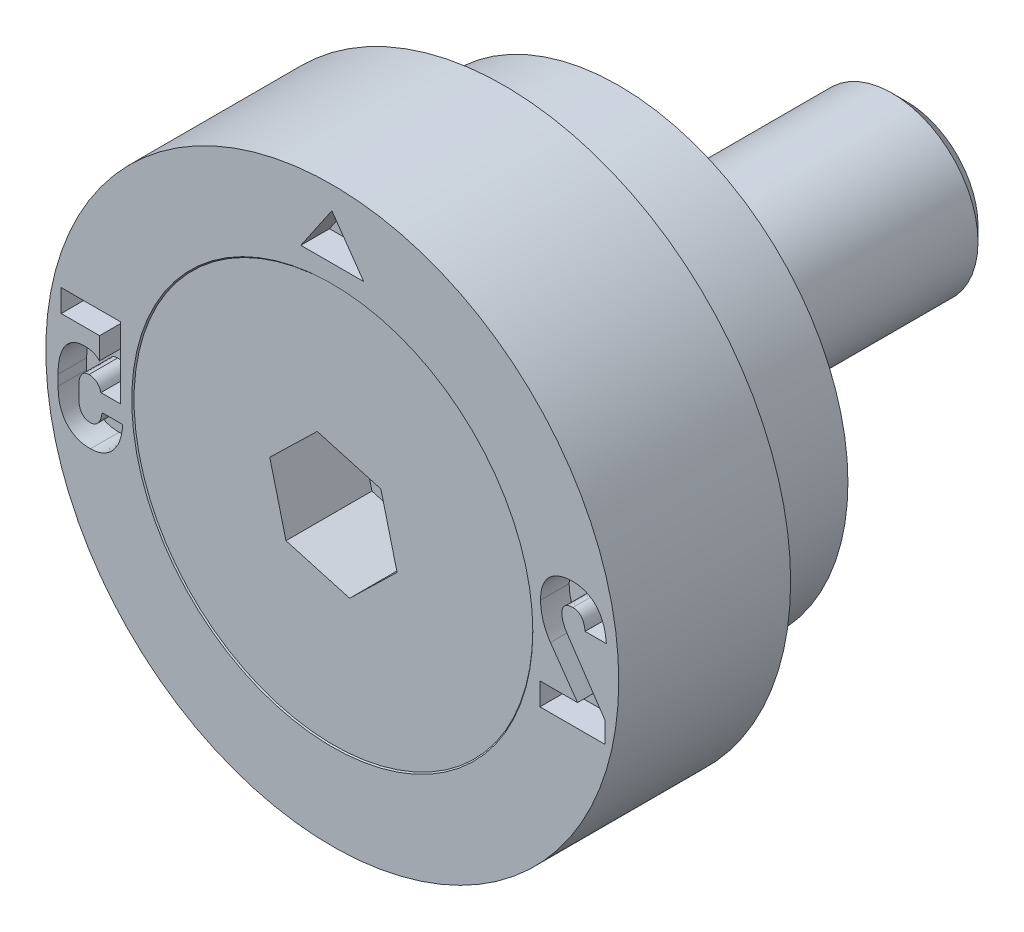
ISO-10303-21;
HEADER;
FILE_DESCRIPTION(('STEP AP214'),'2;1');
FILE_NAME('part.step','',(''),(''),'','','');
FILE_SCHEMA(('AUTOMOTIVE_DESIGN { 1 0 10303 214 1 1 1 1 }'));
ENDSEC;
DATA;
#1=APPLICATION_CONTEXT('core data for automotive mechanical design processes');
#2=APPLICATION_PROTOCOL_DEFINITION('international standard','automotive_design',2000,#1);
#3=PRODUCT_CONTEXT('',#1,'mechanical');
#4=PRODUCT('Part','Part','',(#3));
#5=PRODUCT_RELATED_PRODUCT_CATEGORY('part','',(#4));
#6=PRODUCT_DEFINITION_FORMATION('','',#4);
#7=PRODUCT_DEFINITION_CONTEXT('part definition',#1,'design');
#8=PRODUCT_DEFINITION('design','',#6,#7);
#9=PRODUCT_DEFINITION_SHAPE('','',#8);
#10=(LENGTH_UNIT() NAMED_UNIT(*) SI_UNIT(.MILLI.,.METRE.));
#11=(NAMED_UNIT(*) PLANE_ANGLE_UNIT() SI_UNIT($,.RADIAN.));
#12=(NAMED_UNIT(*) SI_UNIT($,.STERADIAN.) SOLID_ANGLE_UNIT());
#13=UNCERTAINTY_MEASURE_WITH_UNIT(LENGTH_MEASURE(1.E-05),#10,'distance_accuracy_value','');
#14=(GEOMETRIC_REPRESENTATION_CONTEXT(3) GLOBAL_UNCERTAINTY_ASSIGNED_CONTEXT((#13)) GLOBAL_UNIT_ASSIGNED_CONTEXT((#10,
#11,#12)) REPRESENTATION_CONTEXT('',''));
#15=CARTESIAN_POINT('',(0.,0.,0.));
#16=DIRECTION('',(0.,0.,1.));
#17=DIRECTION('',(1.,0.,0.));
#18=AXIS2_PLACEMENT_3D('',#15,#16,#17);
#19=CARTESIAN_POINT('',(0.,0.,-0.0200000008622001));
#20=DIRECTION('',(0.,0.,1.));
#21=DIRECTION('',(1.,0.,0.));
#22=AXIS2_PLACEMENT_3D('',#19,#20,#21);
#23=CYLINDRICAL_SURFACE('',#22,1.5);
#24=CARTESIAN_POINT('',(0.,0.,-2.0000000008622));
#25=DIRECTION('',(0.,0.,1.));
#26=DIRECTION('',(1.,0.,0.));
#27=AXIS2_PLACEMENT_3D('',#24,#25,#26);
#28=CIRCLE('',#27,1.5);
#29=CARTESIAN_POINT('',(1.5,0.,-2.0000000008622));
#30=VERTEX_POINT('',#29);
#31=EDGE_CURVE('E12',#30,#30,#28,.T.);
#32=ORIENTED_EDGE('',*,*,#31,.F.);
#33=EDGE_LOOP('',(#32));
#34=FACE_BOUND('',#33,.T.);
#35=CARTESIAN_POINT('',(0.,0.,-9.7700000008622));
#36=DIRECTION('',(0.,0.,1.));
#37=DIRECTION('',(1.,0.,0.));
#38=AXIS2_PLACEMENT_3D('',#35,#36,#37);
#39=CIRCLE('',#38,1.5);
#40=CARTESIAN_POINT('',(1.5,0.,-9.7700000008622));
#41=VERTEX_POINT('',#40);
#42=EDGE_CURVE('E148',#41,#41,#39,.T.);
#43=ORIENTED_EDGE('',*,*,#42,.T.);
#44=EDGE_LOOP('',(#43));
#45=FACE_BOUND('',#44,.T.);
#46=ADVANCED_FACE('F47',(#34,#45),#23,.T.);
#47=CARTESIAN_POINT('',(0.,0.,-2.0000000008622));
#48=DIRECTION('',(0.,0.,1.));
#49=DIRECTION('',(1.,0.,0.));
#50=AXIS2_PLACEMENT_3D('',#47,#48,#49);
#51=CONICAL_SURFACE('',#50,1.5,0.785398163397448);
#52=CARTESIAN_POINT('',(0.,0.,-0.0200000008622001));
#53=DIRECTION('',(0.,0.,1.));
#54=DIRECTION('',(1.,0.,0.));
#55=AXIS2_PLACEMENT_3D('',#52,#53,#54);
#56=CIRCLE('',#55,3.48);
#57=CARTESIAN_POINT('',(3.48,0.,-0.0200000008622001));
#58=VERTEX_POINT('',#57);
#59=EDGE_CURVE('E54',#58,#58,#56,.T.);
#60=ORIENTED_EDGE('',*,*,#59,.F.);
#61=EDGE_LOOP('',(#60));
#62=FACE_BOUND('',#61,.T.);
#63=ORIENTED_EDGE('',*,*,#31,.T.);
#64=EDGE_LOOP('',(#63));
#65=FACE_BOUND('',#64,.T.);
#66=ADVANCED_FACE('F163',(#62,#65),#51,.T.);
#67=CARTESIAN_POINT('',(0.,3.48,-0.0200000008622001));
#68=DIRECTION('',(0.,0.,-1.));
#69=DIRECTION('',(-1.,0.,0.));
#70=AXIS2_PLACEMENT_3D('',#67,#68,#69);
#71=PLANE('',#70);
#72=DIRECTION('',(0.962144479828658,-0.272539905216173,0.));
#73=VECTOR('',#72,1.);
#74=CARTESIAN_POINT('',(-0.828034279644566,-0.804793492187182,-0.0200000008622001));
#75=LINE('',#74,#73);
#76=CARTESIAN_POINT('',(-0.828034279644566,-0.804793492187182,-0.0200000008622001));
#77=VERTEX_POINT('',#76);
#78=CARTESIAN_POINT('',(0.282954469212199,-1.11949546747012,-0.0200000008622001));
#79=VERTEX_POINT('',#78);
#80=EDGE_CURVE('E135',#77,#79,#75,.T.);
#81=ORIENTED_EDGE('',*,*,#80,.F.);
#82=DIRECTION('',(0.245045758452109,-0.969511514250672,0.));
#83=VECTOR('',#82,1.);
#84=CARTESIAN_POINT('',(-1.11098874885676,0.314701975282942,-0.0200000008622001));
#85=LINE('',#84,#83);
#86=CARTESIAN_POINT('',(-1.11098874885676,0.314701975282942,-0.0200000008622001));
#87=VERTEX_POINT('',#86);
#88=EDGE_CURVE('E61',#87,#77,#85,.T.);
#89=ORIENTED_EDGE('',*,*,#88,.F.);
#90=DIRECTION('',(-0.717098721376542,-0.696971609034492,0.));
#91=VECTOR('',#90,1.);
#92=CARTESIAN_POINT('',(-0.282954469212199,1.11949546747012,-0.0200000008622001));
#93=LINE('',#92,#91);
#94=CARTESIAN_POINT('',(-0.282954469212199,1.11949546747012,-0.0200000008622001));
#95=VERTEX_POINT('',#94);
#96=EDGE_CURVE('E144',#95,#87,#93,.T.);
#97=ORIENTED_EDGE('',*,*,#96,.F.);
#98=DIRECTION('',(-0.962144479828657,0.272539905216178,0.));
#99=VECTOR('',#98,1.);
#100=CARTESIAN_POINT('',(0.828034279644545,0.804793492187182,-0.0200000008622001));
#101=LINE('',#100,#99);
#102=CARTESIAN_POINT('',(0.828034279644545,0.804793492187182,-0.0200000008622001));
#103=VERTEX_POINT('',#102);
#104=EDGE_CURVE('E142',#103,#95,#101,.T.);
#105=ORIENTED_EDGE('',*,*,#104,.F.);
#106=DIRECTION('',(-0.245045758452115,0.96951151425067,0.));
#107=VECTOR('',#106,1.);
#108=CARTESIAN_POINT('',(1.11098874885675,-0.314701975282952,-0.0200000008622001));
#109=LINE('',#108,#107);
#110=CARTESIAN_POINT('',(1.11098874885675,-0.314701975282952,-0.0200000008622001));
#111=VERTEX_POINT('',#110);
#112=EDGE_CURVE('E109',#111,#103,#109,.T.);
#113=ORIENTED_EDGE('',*,*,#112,.F.);
#114=DIRECTION('',(0.717098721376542,0.696971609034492,0.));
#115=VECTOR('',#114,1.);
#116=CARTESIAN_POINT('',(0.282954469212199,-1.11949546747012,-0.0200000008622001));
#117=LINE('',#116,#115);
#118=EDGE_CURVE('E138',#79,#111,#117,.T.);
#119=ORIENTED_EDGE('',*,*,#118,.F.);
#120=EDGE_LOOP('',(#81,#89,#97,#105,#113,#119));
#121=FACE_BOUND('',#120,.T.);
#122=ORIENTED_EDGE('',*,*,#59,.T.);
#123=EDGE_LOOP('',(#122));
#124=FACE_BOUND('',#123,.T.);
#125=ADVANCED_FACE('F161',(#121,#124),#71,.F.);
#126=CARTESIAN_POINT('',(0.,0.,-10.0200000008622));
#127=DIRECTION('',(0.,0.,1.));
#128=DIRECTION('',(1.,0.,0.));
#129=AXIS2_PLACEMENT_3D('',#126,#127,#128);
#130=PLANE('',#129);
#131=CARTESIAN_POINT('',(0.,0.,-10.0200000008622));
#132=DIRECTION('',(0.,0.,1.));
#133=DIRECTION('',(1.,0.,0.));
#134=AXIS2_PLACEMENT_3D('',#131,#132,#133);
#135=CIRCLE('',#134,1.25);
#136=CARTESIAN_POINT('',(1.25,0.,-10.0200000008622));
#137=VERTEX_POINT('',#136);
#138=EDGE_CURVE('E156',#137,#137,#135,.T.);
#139=ORIENTED_EDGE('',*,*,#138,.F.);
#140=EDGE_LOOP('',(#139));
#141=FACE_BOUND('',#140,.T.);
#142=ADVANCED_FACE('F176',(#141),#130,.F.);
#143=CARTESIAN_POINT('',(0.,0.,-10.0200000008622));
#144=DIRECTION('',(0.,0.,1.));
#145=DIRECTION('',(1.,0.,0.));
#146=AXIS2_PLACEMENT_3D('',#143,#144,#145);
#147=CONICAL_SURFACE('',#146,1.25,0.78539816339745);
#148=ORIENTED_EDGE('',*,*,#42,.F.);
#149=EDGE_LOOP('',(#148));
#150=FACE_BOUND('',#149,.T.);
#151=ORIENTED_EDGE('',*,*,#138,.T.);
#152=EDGE_LOOP('',(#151));
#153=FACE_BOUND('',#152,.T.);
#154=ADVANCED_FACE('F172',(#150,#153),#147,.T.);
#155=CARTESIAN_POINT('',(-1.11098874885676,0.314701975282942,-1.5200000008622));
#156=DIRECTION('',(-0.969511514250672,-0.245045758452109,0.));
#157=DIRECTION('',(0.245045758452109,-0.969511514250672,0.));
#158=AXIS2_PLACEMENT_3D('',#155,#156,#157);
#159=PLANE('',#158);
#160=ORIENTED_EDGE('',*,*,#88,.T.);
#161=DIRECTION('',(0.,0.,1.));
#162=VECTOR('',#161,1.);
#163=CARTESIAN_POINT('',(-0.828034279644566,-0.804793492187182,-1.5200000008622));
#164=LINE('',#163,#162);
#165=CARTESIAN_POINT('',(-0.828034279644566,-0.804793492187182,-1.5200000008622));
#166=VERTEX_POINT('',#165);
#167=EDGE_CURVE('E91',#166,#77,#164,.T.);
#168=ORIENTED_EDGE('',*,*,#167,.F.);
#169=DIRECTION('',(0.245045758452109,-0.969511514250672,0.));
#170=VECTOR('',#169,1.);
#171=CARTESIAN_POINT('',(-1.11098874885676,0.314701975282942,-1.5200000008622));
#172=LINE('',#171,#170);
#173=CARTESIAN_POINT('',(-1.11098874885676,0.314701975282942,-1.5200000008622));
#174=VERTEX_POINT('',#173);
#175=EDGE_CURVE('E146',#174,#166,#172,.T.);
#176=ORIENTED_EDGE('',*,*,#175,.F.);
#177=DIRECTION('',(0.,0.,1.));
#178=VECTOR('',#177,1.);
#179=CARTESIAN_POINT('',(-1.11098874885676,0.314701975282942,-1.5200000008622));
#180=LINE('',#179,#178);
#181=EDGE_CURVE('E69',#174,#87,#180,.T.);
#182=ORIENTED_EDGE('',*,*,#181,.T.);
#183=EDGE_LOOP('',(#160,#168,#176,#182));
#184=FACE_BOUND('',#183,.T.);
#185=ADVANCED_FACE('F175',(#184),#159,.F.);
#186=CARTESIAN_POINT('',(-0.282954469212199,1.11949546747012,-1.5200000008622));
#187=DIRECTION('',(-0.696971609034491,0.717098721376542,0.));
#188=DIRECTION('',(-0.717098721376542,-0.696971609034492,0.));
#189=AXIS2_PLACEMENT_3D('',#186,#187,#188);
#190=PLANE('',#189);
#191=ORIENTED_EDGE('',*,*,#96,.T.);
#192=ORIENTED_EDGE('',*,*,#181,.F.);
#193=DIRECTION('',(-0.717098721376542,-0.696971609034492,0.));
#194=VECTOR('',#193,1.);
#195=CARTESIAN_POINT('',(-0.282954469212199,1.11949546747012,-1.5200000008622));
#196=LINE('',#195,#194);
#197=CARTESIAN_POINT('',(-0.282954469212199,1.11949546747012,-1.5200000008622));
#198=VERTEX_POINT('',#197);
#199=EDGE_CURVE('E121',#198,#174,#196,.T.);
#200=ORIENTED_EDGE('',*,*,#199,.F.);
#201=DIRECTION('',(0.,0.,1.));
#202=VECTOR('',#201,1.);
#203=CARTESIAN_POINT('',(-0.282954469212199,1.11949546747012,-1.5200000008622));
#204=LINE('',#203,#202);
#205=EDGE_CURVE('E113',#198,#95,#204,.T.);
#206=ORIENTED_EDGE('',*,*,#205,.T.);
#207=EDGE_LOOP('',(#191,#192,#200,#206));
#208=FACE_BOUND('',#207,.T.);
#209=ADVANCED_FACE('F191',(#208),#190,.F.);
#210=CARTESIAN_POINT('',(0.828034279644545,0.804793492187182,-1.5200000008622));
#211=DIRECTION('',(0.272539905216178,0.962144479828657,0.));
#212=DIRECTION('',(-0.962144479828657,0.272539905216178,0.));
#213=AXIS2_PLACEMENT_3D('',#210,#211,#212);
#214=PLANE('',#213);
#215=ORIENTED_EDGE('',*,*,#104,.T.);
#216=ORIENTED_EDGE('',*,*,#205,.F.);
#217=DIRECTION('',(-0.962144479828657,0.272539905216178,0.));
#218=VECTOR('',#217,1.);
#219=CARTESIAN_POINT('',(0.828034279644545,0.804793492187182,-1.5200000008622));
#220=LINE('',#219,#218);
#221=CARTESIAN_POINT('',(0.828034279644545,0.804793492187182,-1.5200000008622));
#222=VERTEX_POINT('',#221);
#223=EDGE_CURVE('E117',#222,#198,#220,.T.);
#224=ORIENTED_EDGE('',*,*,#223,.F.);
#225=DIRECTION('',(0.,0.,1.));
#226=VECTOR('',#225,1.);
#227=CARTESIAN_POINT('',(0.828034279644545,0.804793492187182,-1.5200000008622));
#228=LINE('',#227,#226);
#229=EDGE_CURVE('E102',#222,#103,#228,.T.);
#230=ORIENTED_EDGE('',*,*,#229,.T.);
#231=EDGE_LOOP('',(#215,#216,#224,#230));
#232=FACE_BOUND('',#231,.T.);
#233=ADVANCED_FACE('F118',(#232),#214,.F.);
#234=CARTESIAN_POINT('',(1.11098874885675,-0.314701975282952,-1.5200000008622));
#235=DIRECTION('',(0.96951151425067,0.245045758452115,0.));
#236=DIRECTION('',(-0.245045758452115,0.96951151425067,0.));
#237=AXIS2_PLACEMENT_3D('',#234,#235,#236);
#238=PLANE('',#237);
#239=ORIENTED_EDGE('',*,*,#112,.T.);
#240=ORIENTED_EDGE('',*,*,#229,.F.);
#241=DIRECTION('',(-0.245045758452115,0.96951151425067,0.));
#242=VECTOR('',#241,1.);
#243=CARTESIAN_POINT('',(1.11098874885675,-0.314701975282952,-1.5200000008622));
#244=LINE('',#243,#242);
#245=CARTESIAN_POINT('',(1.11098874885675,-0.314701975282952,-1.5200000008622));
#246=VERTEX_POINT('',#245);
#247=EDGE_CURVE('E106',#246,#222,#244,.T.);
#248=ORIENTED_EDGE('',*,*,#247,.F.);
#249=DIRECTION('',(0.,0.,1.));
#250=VECTOR('',#249,1.);
#251=CARTESIAN_POINT('',(1.11098874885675,-0.314701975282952,-1.5200000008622));
#252=LINE('',#251,#250);
#253=EDGE_CURVE('E114',#246,#111,#252,.T.);
#254=ORIENTED_EDGE('',*,*,#253,.T.);
#255=EDGE_LOOP('',(#239,#240,#248,#254));
#256=FACE_BOUND('',#255,.T.);
#257=ADVANCED_FACE('F104',(#256),#238,.F.);
#258=CARTESIAN_POINT('',(0.282954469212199,-1.11949546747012,-1.5200000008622));
#259=DIRECTION('',(0.696971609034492,-0.717098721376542,0.));
#260=DIRECTION('',(0.717098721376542,0.696971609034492,0.));
#261=AXIS2_PLACEMENT_3D('',#258,#259,#260);
#262=PLANE('',#261);
#263=ORIENTED_EDGE('',*,*,#118,.T.);
#264=ORIENTED_EDGE('',*,*,#253,.F.);
#265=DIRECTION('',(0.717098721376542,0.696971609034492,0.));
#266=VECTOR('',#265,1.);
#267=CARTESIAN_POINT('',(0.282954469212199,-1.11949546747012,-1.5200000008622));
#268=LINE('',#267,#266);
#269=CARTESIAN_POINT('',(0.282954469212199,-1.11949546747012,-1.5200000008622));
#270=VERTEX_POINT('',#269);
#271=EDGE_CURVE('E127',#270,#246,#268,.T.);
#272=ORIENTED_EDGE('',*,*,#271,.F.);
#273=DIRECTION('',(0.,0.,1.));
#274=VECTOR('',#273,1.);
#275=CARTESIAN_POINT('',(0.282954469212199,-1.11949546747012,-1.5200000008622));
#276=LINE('',#275,#274);
#277=EDGE_CURVE('E151',#270,#79,#276,.T.);
#278=ORIENTED_EDGE('',*,*,#277,.T.);
#279=EDGE_LOOP('',(#263,#264,#272,#278));
#280=FACE_BOUND('',#279,.T.);
#281=ADVANCED_FACE('F195',(#280),#262,.F.);
#282=CARTESIAN_POINT('',(-0.828034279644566,-0.804793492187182,-1.5200000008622));
#283=DIRECTION('',(-0.272539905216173,-0.962144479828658,0.));
#284=DIRECTION('',(0.962144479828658,-0.272539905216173,0.));
#285=AXIS2_PLACEMENT_3D('',#282,#283,#284);
#286=PLANE('',#285);
#287=ORIENTED_EDGE('',*,*,#80,.T.);
#288=ORIENTED_EDGE('',*,*,#277,.F.);
#289=DIRECTION('',(0.962144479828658,-0.272539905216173,0.));
#290=VECTOR('',#289,1.);
#291=CARTESIAN_POINT('',(-0.828034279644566,-0.804793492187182,-1.5200000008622));
#292=LINE('',#291,#290);
#293=EDGE_CURVE('E129',#166,#270,#292,.T.);
#294=ORIENTED_EDGE('',*,*,#293,.F.);
#295=ORIENTED_EDGE('',*,*,#167,.T.);
#296=EDGE_LOOP('',(#287,#288,#294,#295));
#297=FACE_BOUND('',#296,.T.);
#298=ADVANCED_FACE('F192',(#297),#286,.F.);
#299=CARTESIAN_POINT('',(0.,0.,-1.5200000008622));
#300=DIRECTION('',(0.,0.,1.));
#301=DIRECTION('',(1.,0.,0.));
#302=AXIS2_PLACEMENT_3D('',#299,#300,#301);
#303=PLANE('',#302);
#304=ORIENTED_EDGE('',*,*,#175,.T.);
#305=ORIENTED_EDGE('',*,*,#293,.T.);
#306=ORIENTED_EDGE('',*,*,#271,.T.);
#307=ORIENTED_EDGE('',*,*,#247,.T.);
#308=ORIENTED_EDGE('',*,*,#223,.T.);
#309=ORIENTED_EDGE('',*,*,#199,.T.);
#310=EDGE_LOOP('',(#304,#305,#306,#307,#308,#309));
#311=FACE_BOUND('',#310,.T.);
#312=ADVANCED_FACE('F124',(#311),#303,.T.);
#313=CLOSED_SHELL('',(#46,#66,#125,#142,#154,#185,#209,#233,#257,#281,#298,#312));
#314=MANIFOLD_SOLID_BREP('B2',#313);
#315=CARTESIAN_POINT('',(0.,0.,3.12219627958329));
#316=DIRECTION('',(0.,0.,1.));
#317=DIRECTION('',(1.,0.,0.));
#318=AXIS2_PLACEMENT_3D('',#315,#316,#317);
#319=CYLINDRICAL_SURFACE('',#318,5.);
#320=CARTESIAN_POINT('',(0.,0.,0.));
#321=DIRECTION('',(0.,0.,1.));
#322=DIRECTION('',(1.,0.,0.));
#323=AXIS2_PLACEMENT_3D('',#320,#321,#322);
#324=CIRCLE('',#323,5.);
#325=CARTESIAN_POINT('',(5.,0.,0.));
#326=VERTEX_POINT('',#325);
#327=EDGE_CURVE('E45',#326,#326,#324,.T.);
#328=ORIENTED_EDGE('',*,*,#327,.F.);
#329=EDGE_LOOP('',(#328));
#330=FACE_BOUND('',#329,.T.);
#331=CARTESIAN_POINT('',(0.,0.,-3.));
#332=DIRECTION('',(0.,0.,1.));
#333=DIRECTION('',(1.,0.,0.));
#334=AXIS2_PLACEMENT_3D('',#331,#332,#333);
#335=CIRCLE('',#334,5.);
#336=CARTESIAN_POINT('',(5.,0.,-3.));
#337=VERTEX_POINT('',#336);
#338=EDGE_CURVE('E747',#337,#337,#335,.T.);
#339=ORIENTED_EDGE('',*,*,#338,.T.);
#340=EDGE_LOOP('',(#339));
#341=FACE_BOUND('',#340,.T.);
#342=ADVANCED_FACE('F258',(#330,#341),#319,.T.);
#343=CARTESIAN_POINT('',(0.,5.,0.));
#344=DIRECTION('',(0.,0.,-1.));
#345=DIRECTION('',(-1.,0.,0.));
#346=AXIS2_PLACEMENT_3D('',#343,#344,#345);
#347=PLANE('',#346);
#348=DIRECTION('',(-0.560128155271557,0.828405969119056,0.));
#349=VECTOR('',#348,1.);
#350=CARTESIAN_POINT('',(4.75964528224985,-0.712553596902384,0.));
#351=LINE('',#350,#349);
#352=CARTESIAN_POINT('',(4.75964528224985,-0.712553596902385,0.));
#353=VERTEX_POINT('',#352);
#354=CARTESIAN_POINT('',(4.10098968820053,0.26157030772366,0.));
#355=VERTEX_POINT('',#354);
#356=EDGE_CURVE('E1209',#353,#355,#351,.T.);
#357=ORIENTED_EDGE('',*,*,#356,.F.);
#358=DIRECTION('',(0.,1.,0.));
#359=VECTOR('',#358,1.);
#360=CARTESIAN_POINT('',(4.75964528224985,-1.0795,0.));
#361=LINE('',#360,#359);
#362=CARTESIAN_POINT('',(4.75964528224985,-1.0795,0.));
#363=VERTEX_POINT('',#362);
#364=EDGE_CURVE('E272',#363,#353,#361,.T.);
#365=ORIENTED_EDGE('',*,*,#364,.F.);
#366=DIRECTION('',(1.,0.,0.));
#367=VECTOR('',#366,1.);
#368=CARTESIAN_POINT('',(3.62448734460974,-1.0795,0.));
#369=LINE('',#368,#367);
#370=CARTESIAN_POINT('',(3.62448734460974,-1.0795,0.));
#371=VERTEX_POINT('',#370);
#372=EDGE_CURVE('E529',#371,#363,#369,.T.);
#373=ORIENTED_EDGE('',*,*,#372,.F.);
#374=DIRECTION('',(0.,-1.,0.));
#375=VECTOR('',#374,1.);
#376=CARTESIAN_POINT('',(3.62448734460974,-0.68747452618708,0.));
#377=LINE('',#376,#375);
#378=CARTESIAN_POINT('',(3.62448734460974,-0.68747452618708,0.));
#379=VERTEX_POINT('',#378);
#380=EDGE_CURVE('E532',#379,#371,#377,.T.);
#381=ORIENTED_EDGE('',*,*,#380,.F.);
#382=DIRECTION('',(-1.,0.,0.));
#383=VECTOR('',#382,1.);
#384=CARTESIAN_POINT('',(4.2805030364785,-0.68747452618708,0.));
#385=LINE('',#384,#383);
#386=CARTESIAN_POINT('',(4.2805030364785,-0.68747452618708,0.));
#387=VERTEX_POINT('',#386);
#388=EDGE_CURVE('E1277',#387,#379,#385,.T.);
#389=ORIENTED_EDGE('',*,*,#388,.F.);
#390=DIRECTION('',(0.575546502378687,-0.817769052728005,0.));
#391=VECTOR('',#390,1.);
#392=CARTESIAN_POINT('',(3.80796054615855,-0.0160594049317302,0.));
#393=LINE('',#392,#391);
#394=CARTESIAN_POINT('',(3.80796054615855,-0.0160594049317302,0.));
#395=VERTEX_POINT('',#394);
#396=EDGE_CURVE('E1271',#395,#387,#393,.T.);
#397=ORIENTED_EDGE('',*,*,#396,.F.);
#398=CARTESIAN_POINT('',(3.63504695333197,0.537440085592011,0.));
#399=CARTESIAN_POINT('',(3.63547137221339,0.512917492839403,0.));
#400=CARTESIAN_POINT('',(3.63632044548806,0.463858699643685,0.));
#401=CARTESIAN_POINT('',(3.64581587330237,0.390679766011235,0.));
#402=CARTESIAN_POINT('',(3.65956512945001,0.31761093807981,0.));
#403=CARTESIAN_POINT('',(3.68008126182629,0.245575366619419,0.));
#404=CARTESIAN_POINT('',(3.70468903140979,0.175156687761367,0.));
#405=CARTESIAN_POINT('',(3.73455808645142,0.107954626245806,0.));
#406=CARTESIAN_POINT('',(3.76802416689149,0.0437144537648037,0.));
#407=CARTESIAN_POINT('',(3.79468507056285,0.00381035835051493,0.));
#408=CARTESIAN_POINT('',(3.80796054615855,-0.0160594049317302,0.));
#409=B_SPLINE_CURVE_WITH_KNOTS('',3,(#398,#399,#400,#401,#402,#403,#404,#405,#406,#407,#408),
.UNSPECIFIED.,.F.,.F.,(4,1,1,1,1,1,1,1,4),(0.,0.124932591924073,0.249934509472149,
0.375589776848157,0.503650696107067,0.631337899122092,0.755525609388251,0.878266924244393,1.),.UNSPECIFIED.);
#410=CARTESIAN_POINT('',(3.63504695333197,0.537440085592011,0.));
#411=VERTEX_POINT('',#410);
#412=EDGE_CURVE('E1266',#411,#395,#409,.T.);
#413=ORIENTED_EDGE('',*,*,#412,.F.);
#414=DIRECTION('',(0.,-1.,0.));
#415=VECTOR('',#414,1.);
#416=CARTESIAN_POINT('',(3.63504695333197,0.53920002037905,0.));
#417=LINE('',#416,#415);
#418=CARTESIAN_POINT('',(3.63504695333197,0.53920002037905,0.));
#419=VERTEX_POINT('',#418);
#420=EDGE_CURVE('E1260',#419,#411,#417,.T.);
#421=ORIENTED_EDGE('',*,*,#420,.F.);
#422=CARTESIAN_POINT('',(4.20262592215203,1.10193916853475,0.));
#423=CARTESIAN_POINT('',(4.17368500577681,1.10127983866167,0.));
#424=CARTESIAN_POINT('',(4.11786545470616,1.10000816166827,0.));
#425=CARTESIAN_POINT('',(4.03737632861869,1.08742105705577,0.));
#426=CARTESIAN_POINT('',(3.96335454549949,1.06698832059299,0.));
#427=CARTESIAN_POINT('',(3.89591026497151,1.03788598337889,0.));
#428=CARTESIAN_POINT('',(3.83569019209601,1.00069718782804,0.));
#429=CARTESIAN_POINT('',(3.78239739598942,0.956276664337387,0.));
#430=CARTESIAN_POINT('',(3.73710347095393,0.903795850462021,0.));
#431=CARTESIAN_POINT('',(3.70012239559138,0.843593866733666,0.));
#432=CARTESIAN_POINT('',(3.67036324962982,0.776974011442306,0.));
#433=CARTESIAN_POINT('',(3.65005595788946,0.703247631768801,0.));
#434=CARTESIAN_POINT('',(3.63687857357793,0.623418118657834,0.));
#435=CARTESIAN_POINT('',(3.63567015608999,0.567854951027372,0.));
#436=CARTESIAN_POINT('',(3.63504695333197,0.53920002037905,0.));
#437=B_SPLINE_CURVE_WITH_KNOTS('',3,(#422,#423,#424,#425,#426,#427,#428,#429,#430,#431,#432,
#433,#434,#435,#436),.UNSPECIFIED.,.F.,.F.,(4,1,1,1,1,1,1,1,1,1,1,1,4),(0.,0.0954946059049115,
0.184184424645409,0.268193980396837,0.348437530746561,0.425843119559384,0.50111232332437,
0.576641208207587,0.653635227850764,0.733630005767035,0.816707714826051,0.905472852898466,1.),.UNSPECIFIED.);
#438=CARTESIAN_POINT('',(4.20262592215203,1.10193916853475,0.));
#439=VERTEX_POINT('',#438);
#440=EDGE_CURVE('E1252',#439,#419,#437,.T.);
#441=ORIENTED_EDGE('',*,*,#440,.F.);
#442=CARTESIAN_POINT('',(4.78340440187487,0.456043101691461,0.));
#443=CARTESIAN_POINT('',(4.78087077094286,0.488547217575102,0.));
#444=CARTESIAN_POINT('',(4.77594099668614,0.551791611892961,0.));
#445=CARTESIAN_POINT('',(4.75729413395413,0.64240553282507,0.));
#446=CARTESIAN_POINT('',(4.7328286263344,0.726555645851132,0.));
#447=CARTESIAN_POINT('',(4.69899743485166,0.802826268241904,0.));
#448=CARTESIAN_POINT('',(4.65890696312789,0.872011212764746,0.));
#449=CARTESIAN_POINT('',(4.61095803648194,0.9320943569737,0.));
#450=CARTESIAN_POINT('',(4.55712458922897,0.984177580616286,0.));
#451=CARTESIAN_POINT('',(4.49655366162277,1.0269815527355,0.));
#452=CARTESIAN_POINT('',(4.43004497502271,1.06049424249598,0.));
#453=CARTESIAN_POINT('',(4.35862770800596,1.08500574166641,0.));
#454=CARTESIAN_POINT('',(4.2820891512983,1.09918070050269,0.));
#455=CARTESIAN_POINT('',(4.22952343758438,1.10100545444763,0.));
#456=CARTESIAN_POINT('',(4.20262592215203,1.10193916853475,0.));
#457=B_SPLINE_CURVE_WITH_KNOTS('',3,(#442,#443,#444,#445,#446,#447,#448,#449,#450,#451,#452,
#453,#454,#455,#456),.UNSPECIFIED.,.F.,.F.,(4,1,1,1,1,1,1,1,1,1,1,1,4),(0.,0.100707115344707,
0.195949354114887,0.285463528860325,0.371145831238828,0.453268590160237,0.532017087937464,
0.608024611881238,0.684141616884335,0.76039087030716,0.837538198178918,0.916869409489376,1.),.UNSPECIFIED.);
#458=CARTESIAN_POINT('',(4.78340440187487,0.456043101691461,0.));
#459=VERTEX_POINT('',#458);
#460=EDGE_CURVE('E1247',#459,#439,#457,.T.);
#461=ORIENTED_EDGE('',*,*,#460,.F.);
#462=DIRECTION('',(0.,1.,0.));
#463=VECTOR('',#462,1.);
#464=CARTESIAN_POINT('',(4.78340440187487,0.454283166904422,0.));
#465=LINE('',#464,#463);
#466=CARTESIAN_POINT('',(4.78340440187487,0.454283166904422,0.));
#467=VERTEX_POINT('',#466);
#468=EDGE_CURVE('E1244',#467,#459,#465,.T.);
#469=ORIENTED_EDGE('',*,*,#468,.F.);
#470=DIRECTION('',(1.,0.,0.));
#471=VECTOR('',#470,1.);
#472=CARTESIAN_POINT('',(4.41249814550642,0.454283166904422,0.));
#473=LINE('',#472,#471);
#474=CARTESIAN_POINT('',(4.41249814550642,0.454283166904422,0.));
#475=VERTEX_POINT('',#474);
#476=EDGE_CURVE('E1241',#475,#467,#473,.T.);
#477=ORIENTED_EDGE('',*,*,#476,.F.);
#478=DIRECTION('',(0.,-1.,0.));
#479=VECTOR('',#478,1.);
#480=CARTESIAN_POINT('',(4.41249814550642,0.456043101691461,0.));
#481=LINE('',#480,#479);
#482=CARTESIAN_POINT('',(4.41249814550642,0.456043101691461,0.));
#483=VERTEX_POINT('',#482);
#484=EDGE_CURVE('E1235',#483,#475,#481,.T.);
#485=ORIENTED_EDGE('',*,*,#484,.F.);
#486=CARTESIAN_POINT('',(4.19998601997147,0.709913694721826,0.));
#487=CARTESIAN_POINT('',(4.21431413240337,0.709257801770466,0.));
#488=CARTESIAN_POINT('',(4.24208465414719,0.707986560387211,0.));
#489=CARTESIAN_POINT('',(4.28154574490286,0.695008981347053,0.));
#490=CARTESIAN_POINT('',(4.31670204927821,0.673922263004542,0.));
#491=CARTESIAN_POINT('',(4.34679978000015,0.644113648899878,0.));
#492=CARTESIAN_POINT('',(4.37212128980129,0.607126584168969,0.));
#493=CARTESIAN_POINT('',(4.39115068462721,0.562802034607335,0.));
#494=CARTESIAN_POINT('',(4.40546061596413,0.511906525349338,0.));
#495=CARTESIAN_POINT('',(4.41006596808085,0.475349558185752,0.));
#496=CARTESIAN_POINT('',(4.41249814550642,0.456043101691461,0.));
#497=B_SPLINE_CURVE_WITH_KNOTS('',3,(#486,#487,#488,#489,#490,#491,#492,#493,#494,#495,#496),
.UNSPECIFIED.,.F.,.F.,(4,1,1,1,1,1,1,1,4),(0.,0.116724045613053,0.226232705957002,
0.335347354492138,0.448891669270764,0.569535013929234,0.699344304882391,0.841217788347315,1.),.UNSPECIFIED.);
#498=CARTESIAN_POINT('',(4.19998601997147,0.709913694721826,0.));
#499=VERTEX_POINT('',#498);
#500=EDGE_CURVE('E1227',#499,#483,#497,.T.);
#501=ORIENTED_EDGE('',*,*,#500,.F.);
#502=CARTESIAN_POINT('',(4.00727316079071,0.527320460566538,0.));
#503=CARTESIAN_POINT('',(4.00779787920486,0.541160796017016,0.));
#504=CARTESIAN_POINT('',(4.00879379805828,0.567429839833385,0.));
#505=CARTESIAN_POINT('',(4.01807070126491,0.604541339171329,0.));
#506=CARTESIAN_POINT('',(4.0342186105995,0.636514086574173,0.));
#507=CARTESIAN_POINT('',(4.05651139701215,0.663478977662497,0.));
#508=CARTESIAN_POINT('',(4.08500025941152,0.684451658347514,0.));
#509=CARTESIAN_POINT('',(4.1187083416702,0.699570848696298,0.));
#510=CARTESIAN_POINT('',(4.1577567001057,0.708270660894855,0.));
#511=CARTESIAN_POINT('',(4.18542149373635,0.709347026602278,0.));
#512=CARTESIAN_POINT('',(4.19998601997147,0.709913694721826,0.));
#513=B_SPLINE_CURVE_WITH_KNOTS('',3,(#502,#503,#504,#505,#506,#507,#508,#509,#510,#511,#512),
.UNSPECIFIED.,.F.,.F.,(4,1,1,1,1,1,1,1,4),(0.,0.137390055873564,0.260767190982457,
0.376796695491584,0.490635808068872,0.605200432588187,0.725225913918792,0.855341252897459,1.),.UNSPECIFIED.);
#514=CARTESIAN_POINT('',(4.00727316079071,0.527320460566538,0.));
#515=VERTEX_POINT('',#514);
#516=EDGE_CURVE('E1222',#515,#499,#513,.T.);
#517=ORIENTED_EDGE('',*,*,#516,.F.);
#518=DIRECTION('',(0.,1.,0.));
#519=VECTOR('',#518,1.);
#520=CARTESIAN_POINT('',(4.00727316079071,0.524240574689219,0.));
#521=LINE('',#520,#519);
#522=CARTESIAN_POINT('',(4.00727316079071,0.524240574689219,0.));
#523=VERTEX_POINT('',#522);
#524=EDGE_CURVE('E1216',#523,#515,#521,.T.);
#525=ORIENTED_EDGE('',*,*,#524,.F.);
#526=CARTESIAN_POINT('',(4.10098968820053,0.26157030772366,0.));
#527=CARTESIAN_POINT('',(4.08711782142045,0.283206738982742,0.));
#528=CARTESIAN_POINT('',(4.0598552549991,0.325729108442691,0.));
#529=CARTESIAN_POINT('',(4.03579825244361,0.383457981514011,0.));
#530=CARTESIAN_POINT('',(4.02042127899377,0.428894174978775,0.));
#531=CARTESIAN_POINT('',(4.01338456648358,0.461868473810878,0.));
#532=CARTESIAN_POINT('',(4.00782554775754,0.493402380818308,0.));
#533=CARTESIAN_POINT('',(4.00745485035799,0.514097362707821,0.));
#534=CARTESIAN_POINT('',(4.00727316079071,0.524240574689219,0.));
#535=B_SPLINE_CURVE_WITH_KNOTS('',3,(#526,#527,#528,#529,#530,#531,#532,#533,#534),
.UNSPECIFIED.,.F.,.F.,(4,1,1,1,1,1,4),(0.,0.272236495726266,0.535030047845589,0.661020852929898,
0.780702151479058,0.892515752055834,1.),.UNSPECIFIED.);
#536=EDGE_CURVE('E1211',#355,#523,#535,.T.);
#537=ORIENTED_EDGE('',*,*,#536,.F.);
#538=EDGE_LOOP('',(#357,#365,#373,#381,#389,#397,#413,#421,#441,#461,#469,#477,#485,#501,#517,
#525,#537));
#539=FACE_BOUND('',#538,.T.);
#540=CARTESIAN_POINT('',(-4.22024597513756,-1.10193916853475,0.));
#541=CARTESIAN_POINT('',(-4.19508907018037,-1.10106349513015,0.));
#542=CARTESIAN_POINT('',(-4.14566002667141,-1.099342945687,0.));
#543=CARTESIAN_POINT('',(-4.07361051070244,-1.08410505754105,0.));
#544=CARTESIAN_POINT('',(-4.00519747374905,-1.06046176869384,0.));
#545=CARTESIAN_POINT('',(-3.94113442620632,-1.02680221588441,0.));
#546=CARTESIAN_POINT('',(-3.88219560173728,-0.983898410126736,0.));
#547=CARTESIAN_POINT('',(-3.82957256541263,-0.931661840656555,0.));
#548=CARTESIAN_POINT('',(-3.78251018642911,-0.871303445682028,0.));
#549=CARTESIAN_POINT('',(-3.74220280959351,-0.802319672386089,0.));
#550=CARTESIAN_POINT('',(-3.70854005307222,-0.725650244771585,0.));
#551=CARTESIAN_POINT('',(-3.68417679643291,-0.641352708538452,0.));
#552=CARTESIAN_POINT('',(-3.66539133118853,-0.550918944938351,0.));
#553=CARTESIAN_POINT('',(-3.66047418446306,-0.48796231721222,0.));
#554=CARTESIAN_POINT('',(-3.65794681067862,-0.455603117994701,0.));
#555=B_SPLINE_CURVE_WITH_KNOTS('',3,(#540,#541,#542,#543,#544,#545,#546,#547,#548,#549,#550,
#551,#552,#553,#554),.UNSPECIFIED.,.F.,.F.,(4,1,1,1,1,1,1,1,1,1,1,1,4),(0.,0.0790734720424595,
0.15536593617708,0.23067372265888,0.306220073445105,0.382183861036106,0.459194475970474,
0.538764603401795,0.622339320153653,0.709959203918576,0.801497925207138,0.897971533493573,1.),.UNSPECIFIED.);
#556=CARTESIAN_POINT('',(-4.22024597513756,-1.10193916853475,0.));
#557=VERTEX_POINT('',#556);
#558=CARTESIAN_POINT('',(-3.65794681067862,-0.455603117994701,0.));
#559=VERTEX_POINT('',#558);
#560=EDGE_CURVE('E596',#557,#559,#555,.T.);
#561=ORIENTED_EDGE('',*,*,#560,.F.);
#562=CARTESIAN_POINT('',(-4.78650499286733,-0.439323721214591,0.));
#563=CARTESIAN_POINT('',(-4.7858935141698,-0.472958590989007,0.));
#564=CARTESIAN_POINT('',(-4.784711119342,-0.537997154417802,0.));
#565=CARTESIAN_POINT('',(-4.77144938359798,-0.631668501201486,0.));
#566=CARTESIAN_POINT('',(-4.7513909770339,-0.71824121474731,0.));
#567=CARTESIAN_POINT('',(-4.72171422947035,-0.796735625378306,0.));
#568=CARTESIAN_POINT('',(-4.68501092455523,-0.867336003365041,0.));
#569=CARTESIAN_POINT('',(-4.63996965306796,-0.92911845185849,0.));
#570=CARTESIAN_POINT('',(-4.58716868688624,-0.981800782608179,0.));
#571=CARTESIAN_POINT('',(-4.52731331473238,-1.02600960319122,0.));
#572=CARTESIAN_POINT('',(-4.4598286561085,-1.06002139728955,0.));
#573=CARTESIAN_POINT('',(-4.385927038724,-1.08467976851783,0.));
#574=CARTESIAN_POINT('',(-4.30515705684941,-1.09940897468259,0.));
#575=CARTESIAN_POINT('',(-4.24920140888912,-1.10107634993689,0.));
#576=CARTESIAN_POINT('',(-4.22024597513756,-1.10193916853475,0.));
#577=B_SPLINE_CURVE_WITH_KNOTS('',3,(#562,#563,#564,#565,#566,#567,#568,#569,#570,#571,#572,
#573,#574,#575,#576),.UNSPECIFIED.,.F.,.F.,(4,1,1,1,1,1,1,1,1,1,1,1,4),(0.,0.101974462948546,
0.197184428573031,0.286436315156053,0.371064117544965,0.451078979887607,0.527172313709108,
0.602055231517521,0.676545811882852,0.75196617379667,0.830341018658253,0.912206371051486,1.),.UNSPECIFIED.);
#578=CARTESIAN_POINT('',(-4.78650499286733,-0.439323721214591,0.));
#579=VERTEX_POINT('',#578);
#580=EDGE_CURVE('E280',#579,#557,#577,.T.);
#581=ORIENTED_EDGE('',*,*,#580,.F.);
#582=DIRECTION('',(0.,-1.,0.));
#583=VECTOR('',#582,1.);
#584=CARTESIAN_POINT('',(-4.78650499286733,-0.258490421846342,0.));
#585=LINE('',#584,#583);
#586=CARTESIAN_POINT('',(-4.78650499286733,-0.258490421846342,0.));
#587=VERTEX_POINT('',#586);
#588=EDGE_CURVE('E682',#587,#579,#585,.T.);
#589=ORIENTED_EDGE('',*,*,#588,.F.);
#590=CARTESIAN_POINT('',(-4.31396250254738,0.402365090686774,0.));
#591=CARTESIAN_POINT('',(-4.33794243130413,0.401477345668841,0.));
#592=CARTESIAN_POINT('',(-4.38475301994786,0.399744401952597,0.));
#593=CARTESIAN_POINT('',(-4.45212655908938,0.385046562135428,0.));
#594=CARTESIAN_POINT('',(-4.51408354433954,0.360454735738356,0.));
#595=CARTESIAN_POINT('',(-4.57042820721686,0.326232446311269,0.));
#596=CARTESIAN_POINT('',(-4.62103930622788,0.282736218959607,0.));
#597=CARTESIAN_POINT('',(-4.66490478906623,0.229886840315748,0.));
#598=CARTESIAN_POINT('',(-4.70262717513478,0.168465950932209,0.));
#599=CARTESIAN_POINT('',(-4.73302264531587,0.0981014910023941,0.));
#600=CARTESIAN_POINT('',(-4.75709013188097,0.0197271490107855,0.));
#601=CARTESIAN_POINT('',(-4.77461792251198,-0.0662921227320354,0.));
#602=CARTESIAN_POINT('',(-4.78451012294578,-0.159995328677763,0.));
#603=CARTESIAN_POINT('',(-4.78582429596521,-0.224881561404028,0.));
#604=CARTESIAN_POINT('',(-4.78650499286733,-0.258490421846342,0.));
#605=B_SPLINE_CURVE_WITH_KNOTS('',3,(#590,#591,#592,#593,#594,#595,#596,#597,#598,#599,#600,
#601,#602,#603,#604),.UNSPECIFIED.,.F.,.F.,(4,1,1,1,1,1,1,1,1,1,1,1,4),(0.,0.0784325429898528,
0.153106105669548,0.224426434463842,0.295728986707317,0.367902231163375,0.441850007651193,
0.519661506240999,0.603065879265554,0.692049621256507,0.787616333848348,0.889992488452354,1.),.UNSPECIFIED.);
#606=CARTESIAN_POINT('',(-4.31396250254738,0.402365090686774,0.));
#607=VERTEX_POINT('',#606);
#608=EDGE_CURVE('E674',#607,#587,#605,.T.);
#609=ORIENTED_EDGE('',*,*,#608,.F.);
#610=CARTESIAN_POINT('',(-4.06185184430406,0.306008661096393,0.));
#611=CARTESIAN_POINT('',(-4.06915639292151,0.313248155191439,0.));
#612=CARTESIAN_POINT('',(-4.08407537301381,0.32803426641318,0.));
#613=CARTESIAN_POINT('',(-4.11034222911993,0.346894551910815,0.));
#614=CARTESIAN_POINT('',(-4.14024484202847,0.363280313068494,0.));
#615=CARTESIAN_POINT('',(-4.18444080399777,0.381562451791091,0.));
#616=CARTESIAN_POINT('',(-4.24258758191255,0.398217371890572,0.));
#617=CARTESIAN_POINT('',(-4.29052301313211,0.401002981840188,0.));
#618=CARTESIAN_POINT('',(-4.31396250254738,0.402365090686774,0.));
#619=B_SPLINE_CURVE_WITH_KNOTS('',3,(#610,#611,#612,#613,#614,#615,#616,#617,#618),
.UNSPECIFIED.,.F.,.F.,(4,1,1,1,1,1,4),(0.,0.111406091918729,0.227538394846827,0.349287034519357,
0.480459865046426,0.745955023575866,1.),.UNSPECIFIED.);
#620=CARTESIAN_POINT('',(-4.06185184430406,0.306008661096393,0.));
#621=VERTEX_POINT('',#620);
#622=EDGE_CURVE('E669',#621,#607,#619,.T.);
#623=ORIENTED_EDGE('',*,*,#622,.F.);
#624=DIRECTION('',(0.,-1.,0.));
#625=VECTOR('',#624,1.);
#626=CARTESIAN_POINT('',(-4.06185184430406,0.68747452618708,0.));
#627=LINE('',#626,#625);
#628=CARTESIAN_POINT('',(-4.06185184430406,0.68747452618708,0.));
#629=VERTEX_POINT('',#628);
#630=EDGE_CURVE('E666',#629,#621,#627,.T.);
#631=ORIENTED_EDGE('',*,*,#630,.F.);
#632=DIRECTION('',(1.,0.,0.));
#633=VECTOR('',#632,1.);
#634=CARTESIAN_POINT('',(-4.73106704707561,0.68747452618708,0.));
#635=LINE('',#634,#633);
#636=CARTESIAN_POINT('',(-4.73106704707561,0.68747452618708,0.));
#637=VERTEX_POINT('',#636);
#638=EDGE_CURVE('E663',#637,#629,#635,.T.);
#639=ORIENTED_EDGE('',*,*,#638,.F.);
#640=DIRECTION('',(0.,-1.,0.));
#641=VECTOR('',#640,1.);
#642=CARTESIAN_POINT('',(-4.73106704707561,1.0795,0.));
#643=LINE('',#642,#641);
#644=CARTESIAN_POINT('',(-4.73106704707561,1.0795,0.));
#645=VERTEX_POINT('',#644);
#646=EDGE_CURVE('E660',#645,#637,#643,.T.);
#647=ORIENTED_EDGE('',*,*,#646,.F.);
#648=DIRECTION('',(-1.,0.,0.));
#649=VECTOR('',#648,1.);
#650=CARTESIAN_POINT('',(-3.70018524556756,1.0795,0.));
#651=LINE('',#650,#649);
#652=CARTESIAN_POINT('',(-3.70018524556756,1.0795,0.));
#653=VERTEX_POINT('',#652);
#654=EDGE_CURVE('E657',#653,#645,#651,.T.);
#655=ORIENTED_EDGE('',*,*,#654,.F.);
#656=DIRECTION('',(0.,1.,0.));
#657=VECTOR('',#656,1.);
#658=CARTESIAN_POINT('',(-3.70018524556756,-0.161694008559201,0.));
#659=LINE('',#658,#657);
#660=CARTESIAN_POINT('',(-3.70018524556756,-0.161694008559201,0.));
#661=VERTEX_POINT('',#660);
#662=EDGE_CURVE('E654',#661,#653,#659,.T.);
#663=ORIENTED_EDGE('',*,*,#662,.F.);
#664=DIRECTION('',(1.,0.,0.));
#665=VECTOR('',#664,1.);
#666=CARTESIAN_POINT('',(-4.03809272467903,-0.161694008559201,0.));
#667=LINE('',#666,#665);
#668=CARTESIAN_POINT('',(-4.03809272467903,-0.161694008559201,0.));
#669=VERTEX_POINT('',#668);
#670=EDGE_CURVE('E648',#669,#661,#667,.T.);
#671=ORIENTED_EDGE('',*,*,#670,.F.);
#672=CARTESIAN_POINT('',(-4.24664499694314,0.00769971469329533,0.));
#673=CARTESIAN_POINT('',(-4.23413094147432,0.00725055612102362,0.));
#674=CARTESIAN_POINT('',(-4.2096842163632,0.00637310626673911,0.));
#675=CARTESIAN_POINT('',(-4.17447350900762,-0.00218654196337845,0.));
#676=CARTESIAN_POINT('',(-4.14216609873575,-0.0165357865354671,0.));
#677=CARTESIAN_POINT('',(-4.11306412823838,-0.0363461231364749,0.));
#678=CARTESIAN_POINT('',(-4.08795055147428,-0.0613514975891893,0.));
#679=CARTESIAN_POINT('',(-4.06630511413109,-0.0903446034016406,0.));
#680=CARTESIAN_POINT('',(-4.04956085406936,-0.124291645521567,0.));
#681=CARTESIAN_POINT('',(-4.04199845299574,-0.148955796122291,0.));
#682=CARTESIAN_POINT('',(-4.03809272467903,-0.161694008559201,0.));
#683=B_SPLINE_CURVE_WITH_KNOTS('',3,(#672,#673,#674,#675,#676,#677,#678,#679,#680,#681,#682),
.UNSPECIFIED.,.F.,.F.,(4,1,1,1,1,1,1,1,4),(0.,0.128801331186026,0.251618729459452,
0.370714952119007,0.49145921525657,0.612241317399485,0.734377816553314,0.862814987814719,1.),.UNSPECIFIED.);
#684=CARTESIAN_POINT('',(-4.24664499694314,0.00769971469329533,0.));
#685=VERTEX_POINT('',#684);
#686=EDGE_CURVE('E640',#685,#669,#683,.T.);
#687=ORIENTED_EDGE('',*,*,#686,.F.);
#688=CARTESIAN_POINT('',(-4.42483839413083,-0.258490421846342,0.));
#689=CARTESIAN_POINT('',(-4.4242805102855,-0.238361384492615,0.));
#690=CARTESIAN_POINT('',(-4.42322386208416,-0.200236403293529,0.));
#691=CARTESIAN_POINT('',(-4.41458273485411,-0.146796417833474,0.));
#692=CARTESIAN_POINT('',(-4.40034647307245,-0.100343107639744,0.));
#693=CARTESIAN_POINT('',(-4.37958913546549,-0.0617299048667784,0.));
#694=CARTESIAN_POINT('',(-4.3540309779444,-0.0303216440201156,0.));
#695=CARTESIAN_POINT('',(-4.32263257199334,-0.00792819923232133,0.));
#696=CARTESIAN_POINT('',(-4.28606982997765,0.00535304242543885,0.));
#697=CARTESIAN_POINT('',(-4.26010284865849,0.00689866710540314,0.));
#698=CARTESIAN_POINT('',(-4.24664499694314,0.00769971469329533,0.));
#699=B_SPLINE_CURVE_WITH_KNOTS('',3,(#688,#689,#690,#691,#692,#693,#694,#695,#696,#697,#698),
.UNSPECIFIED.,.F.,.F.,(4,1,1,1,1,1,1,1,4),(0.,0.167644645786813,0.317523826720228,
0.449701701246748,0.570546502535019,0.680704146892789,0.784127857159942,0.888120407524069,1.),.UNSPECIFIED.);
#700=CARTESIAN_POINT('',(-4.42483839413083,-0.258490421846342,0.));
#701=VERTEX_POINT('',#700);
#702=EDGE_CURVE('E635',#701,#685,#699,.T.);
#703=ORIENTED_EDGE('',*,*,#702,.F.);
#704=DIRECTION('',(0.,1.,0.));
#705=VECTOR('',#704,1.);
#706=CARTESIAN_POINT('',(-4.42483839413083,-0.439323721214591,0.));
#707=LINE('',#706,#705);
#708=CARTESIAN_POINT('',(-4.42483839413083,-0.439323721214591,0.));
#709=VERTEX_POINT('',#708);
#710=EDGE_CURVE('E629',#709,#701,#707,.T.);
#711=ORIENTED_EDGE('',*,*,#710,.F.);
#712=CARTESIAN_POINT('',(-4.22552577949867,-0.706833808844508,0.));
#713=CARTESIAN_POINT('',(-4.24059655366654,-0.706077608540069,0.));
#714=CARTESIAN_POINT('',(-4.26961749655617,-0.704621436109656,0.));
#715=CARTESIAN_POINT('',(-4.310248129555,-0.690934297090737,0.));
#716=CARTESIAN_POINT('',(-4.34542520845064,-0.668727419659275,0.));
#717=CARTESIAN_POINT('',(-4.37442410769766,-0.637370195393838,0.));
#718=CARTESIAN_POINT('',(-4.39727713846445,-0.598130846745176,0.));
#719=CARTESIAN_POINT('',(-4.41328738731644,-0.551334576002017,0.));
#720=CARTESIAN_POINT('',(-4.42358120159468,-0.497701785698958,0.));
#721=CARTESIAN_POINT('',(-4.42440455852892,-0.45946899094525,0.));
#722=CARTESIAN_POINT('',(-4.42483839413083,-0.439323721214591,0.));
#723=B_SPLINE_CURVE_WITH_KNOTS('',3,(#712,#713,#714,#715,#716,#717,#718,#719,#720,#721,#722),
.UNSPECIFIED.,.F.,.F.,(4,1,1,1,1,1,1,1,4),(0.,0.119678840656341,0.230458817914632,
0.337035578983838,0.447729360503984,0.567088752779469,0.695988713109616,0.839813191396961,1.),.UNSPECIFIED.);
#724=CARTESIAN_POINT('',(-4.22552577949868,-0.706833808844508,0.));
#725=VERTEX_POINT('',#724);
#726=EDGE_CURVE('E621',#725,#709,#723,.T.);
#727=ORIENTED_EDGE('',*,*,#726,.F.);
#728=CARTESIAN_POINT('',(-4.01961340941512,-0.455603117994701,0.));
#729=CARTESIAN_POINT('',(-4.02172460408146,-0.474470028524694,0.));
#730=CARTESIAN_POINT('',(-4.02573387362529,-0.510299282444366,0.));
#731=CARTESIAN_POINT('',(-4.03970512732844,-0.56028452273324,0.));
#732=CARTESIAN_POINT('',(-4.05838555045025,-0.603984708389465,0.));
#733=CARTESIAN_POINT('',(-4.08264143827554,-0.640933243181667,0.));
#734=CARTESIAN_POINT('',(-4.11170762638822,-0.670902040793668,0.));
#735=CARTESIAN_POINT('',(-4.1463528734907,-0.69126958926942,0.));
#736=CARTESIAN_POINT('',(-4.18447453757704,-0.70502907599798,0.));
#737=CARTESIAN_POINT('',(-4.21161522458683,-0.70622226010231,0.));
#738=CARTESIAN_POINT('',(-4.22552577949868,-0.706833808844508,0.));
#739=B_SPLINE_CURVE_WITH_KNOTS('',3,(#728,#729,#730,#731,#732,#733,#734,#735,#736,#737,#738),
.UNSPECIFIED.,.F.,.F.,(4,1,1,1,1,1,1,1,4),(0.,0.157927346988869,0.299912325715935,
0.430666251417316,0.552318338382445,0.666357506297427,0.774897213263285,0.884626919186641,1.),.UNSPECIFIED.);
#740=CARTESIAN_POINT('',(-4.01961340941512,-0.455603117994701,0.));
#741=VERTEX_POINT('',#740);
#742=EDGE_CURVE('E616',#741,#725,#739,.T.);
#743=ORIENTED_EDGE('',*,*,#742,.F.);
#744=DIRECTION('',(0.,-1.,0.));
#745=VECTOR('',#744,1.);
#746=CARTESIAN_POINT('',(-4.01961340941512,-0.454283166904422,0.));
#747=LINE('',#746,#745);
#748=CARTESIAN_POINT('',(-4.01961340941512,-0.454283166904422,0.));
#749=VERTEX_POINT('',#748);
#750=EDGE_CURVE('E613',#749,#741,#747,.T.);
#751=ORIENTED_EDGE('',*,*,#750,.F.);
#752=DIRECTION('',(-1.,0.,0.));
#753=VECTOR('',#752,1.);
#754=CARTESIAN_POINT('',(-3.65794681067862,-0.454283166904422,0.));
#755=LINE('',#754,#753);
#756=CARTESIAN_POINT('',(-3.65794681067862,-0.454283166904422,0.));
#757=VERTEX_POINT('',#756);
#758=EDGE_CURVE('E610',#757,#749,#755,.T.);
#759=ORIENTED_EDGE('',*,*,#758,.F.);
#760=DIRECTION('',(0.,1.,0.));
#761=VECTOR('',#760,1.);
#762=CARTESIAN_POINT('',(-3.65794681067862,-0.455603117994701,0.));
#763=LINE('',#762,#761);
#764=EDGE_CURVE('E604',#559,#757,#763,.T.);
#765=ORIENTED_EDGE('',*,*,#764,.F.);
#766=EDGE_LOOP('',(#561,#581,#589,#609,#623,#631,#639,#647,#655,#663,#671,#687,#703,#711,#727,
#743,#751,#759,#765));
#767=FACE_BOUND('',#766,.T.);
#768=DIRECTION('',(-0.573576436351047,0.819152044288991,0.));
#769=VECTOR('',#768,1.);
#770=CARTESIAN_POINT('',(0.548658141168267,3.81,0.));
#771=LINE('',#770,#769);
#772=CARTESIAN_POINT('',(0.548658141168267,3.81,0.));
#773=VERTEX_POINT('',#772);
#774=CARTESIAN_POINT('',(-0.00713159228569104,4.60375,0.));
#775=VERTEX_POINT('',#774);
#776=EDGE_CURVE('E739',#773,#775,#771,.T.);
#777=ORIENTED_EDGE('',*,*,#776,.F.);
#778=DIRECTION('',(1.,0.,0.));
#779=VECTOR('',#778,1.);
#780=CARTESIAN_POINT('',(-0.548658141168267,3.81,0.));
#781=LINE('',#780,#779);
#782=CARTESIAN_POINT('',(-0.548658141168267,3.81,0.));
#783=VERTEX_POINT('',#782);
#784=EDGE_CURVE('E737',#783,#773,#781,.T.);
#785=ORIENTED_EDGE('',*,*,#784,.F.);
#786=DIRECTION('',(-0.563573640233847,-0.826065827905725,0.));
#787=VECTOR('',#786,1.);
#788=CARTESIAN_POINT('',(-0.00713159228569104,4.60375,0.));
#789=LINE('',#788,#787);
#790=EDGE_CURVE('E730',#775,#783,#789,.T.);
#791=ORIENTED_EDGE('',*,*,#790,.F.);
#792=EDGE_LOOP('',(#777,#785,#791));
#793=FACE_BOUND('',#792,.T.);
#794=CARTESIAN_POINT('',(0.,0.,0.));
#795=DIRECTION('',(0.,0.,1.));
#796=DIRECTION('',(1.,0.,0.));
#797=AXIS2_PLACEMENT_3D('',#794,#795,#796);
#798=CIRCLE('',#797,3.5000000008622);
#799=CARTESIAN_POINT('',(3.5000000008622,0.,0.));
#800=VERTEX_POINT('',#799);
#801=EDGE_CURVE('E265',#800,#800,#798,.T.);
#802=ORIENTED_EDGE('',*,*,#801,.F.);
#803=EDGE_LOOP('',(#802));
#804=FACE_BOUND('',#803,.T.);
#805=ORIENTED_EDGE('',*,*,#327,.T.);
#806=EDGE_LOOP('',(#805));
#807=FACE_BOUND('',#806,.T.);
#808=ADVANCED_FACE('F770',(#539,#767,#793,#804,#807),#347,.F.);
#809=CARTESIAN_POINT('',(0.,0.,0.));
#810=DIRECTION('',(0.,0.,1.));
#811=DIRECTION('',(1.,0.,0.));
#812=AXIS2_PLACEMENT_3D('',#809,#810,#811);
#813=CONICAL_SURFACE('',#812,3.5000000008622,0.785398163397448);
#814=CARTESIAN_POINT('',(0.,0.,-2.0000000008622));
#815=DIRECTION('',(0.,0.,1.));
#816=DIRECTION('',(1.,0.,0.));
#817=AXIS2_PLACEMENT_3D('',#814,#815,#816);
#818=CIRCLE('',#817,1.5);
#819=CARTESIAN_POINT('',(1.5,0.,-2.0000000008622));
#820=VERTEX_POINT('',#819);
#821=EDGE_CURVE('E763',#820,#820,#818,.T.);
#822=ORIENTED_EDGE('',*,*,#821,.F.);
#823=EDGE_LOOP('',(#822));
#824=FACE_BOUND('',#823,.T.);
#825=ORIENTED_EDGE('',*,*,#801,.T.);
#826=EDGE_LOOP('',(#825));
#827=FACE_BOUND('',#826,.T.);
#828=ADVANCED_FACE('F768',(#824,#827),#813,.F.);
#829=CARTESIAN_POINT('',(0.,0.,3.12219627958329));
#830=DIRECTION('',(0.,0.,1.));
#831=DIRECTION('',(1.,0.,0.));
#832=AXIS2_PLACEMENT_3D('',#829,#830,#831);
#833=CYLINDRICAL_SURFACE('',#832,1.5);
#834=CARTESIAN_POINT('',(0.,0.,-5.));
#835=DIRECTION('',(0.,0.,1.));
#836=DIRECTION('',(1.,0.,0.));
#837=AXIS2_PLACEMENT_3D('',#834,#835,#836);
#838=CIRCLE('',#837,1.5);
#839=CARTESIAN_POINT('',(1.5,0.,-5.));
#840=VERTEX_POINT('',#839);
#841=EDGE_CURVE('E760',#840,#840,#838,.T.);
#842=ORIENTED_EDGE('',*,*,#841,.F.);
#843=EDGE_LOOP('',(#842));
#844=FACE_BOUND('',#843,.T.);
#845=ORIENTED_EDGE('',*,*,#821,.T.);
#846=EDGE_LOOP('',(#845));
#847=FACE_BOUND('',#846,.T.);
#848=ADVANCED_FACE('F796',(#844,#847),#833,.F.);
#849=CARTESIAN_POINT('',(0.,1.5,-5.));
#850=DIRECTION('',(0.,0.,1.));
#851=DIRECTION('',(1.,0.,0.));
#852=AXIS2_PLACEMENT_3D('',#849,#850,#851);
#853=PLANE('',#852);
#854=CARTESIAN_POINT('',(0.,0.,-5.));
#855=DIRECTION('',(0.,0.,1.));
#856=DIRECTION('',(1.,0.,0.));
#857=AXIS2_PLACEMENT_3D('',#854,#855,#856);
#858=CIRCLE('',#857,4.);
#859=CARTESIAN_POINT('',(4.,0.,-5.));
#860=VERTEX_POINT('',#859);
#861=EDGE_CURVE('E757',#860,#860,#858,.T.);
#862=ORIENTED_EDGE('',*,*,#861,.F.);
#863=EDGE_LOOP('',(#862));
#864=FACE_BOUND('',#863,.T.);
#865=ORIENTED_EDGE('',*,*,#841,.T.);
#866=EDGE_LOOP('',(#865));
#867=FACE_BOUND('',#866,.T.);
#868=ADVANCED_FACE('F790',(#864,#867),#853,.F.);
#869=CARTESIAN_POINT('',(0.,0.,3.12219627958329));
#870=DIRECTION('',(0.,0.,1.));
#871=DIRECTION('',(1.,0.,0.));
#872=AXIS2_PLACEMENT_3D('',#869,#870,#871);
#873=CYLINDRICAL_SURFACE('',#872,4.);
#874=CARTESIAN_POINT('',(0.,0.,-3.));
#875=DIRECTION('',(0.,0.,1.));
#876=DIRECTION('',(1.,0.,0.));
#877=AXIS2_PLACEMENT_3D('',#874,#875,#876);
#878=CIRCLE('',#877,4.);
#879=CARTESIAN_POINT('',(4.,0.,-3.));
#880=VERTEX_POINT('',#879);
#881=EDGE_CURVE('E754',#880,#880,#878,.T.);
#882=ORIENTED_EDGE('',*,*,#881,.F.);
#883=EDGE_LOOP('',(#882));
#884=FACE_BOUND('',#883,.T.);
#885=ORIENTED_EDGE('',*,*,#861,.T.);
#886=EDGE_LOOP('',(#885));
#887=FACE_BOUND('',#886,.T.);
#888=ADVANCED_FACE('F784',(#884,#887),#873,.T.);
#889=CARTESIAN_POINT('',(0.,4.,-3.));
#890=DIRECTION('',(0.,0.,1.));
#891=DIRECTION('',(1.,0.,0.));
#892=AXIS2_PLACEMENT_3D('',#889,#890,#891);
#893=PLANE('',#892);
#894=ORIENTED_EDGE('',*,*,#338,.F.);
#895=EDGE_LOOP('',(#894));
#896=FACE_BOUND('',#895,.T.);
#897=ORIENTED_EDGE('',*,*,#881,.T.);
#898=EDGE_LOOP('',(#897));
#899=FACE_BOUND('',#898,.T.);
#900=ADVANCED_FACE('F780',(#896,#899),#893,.F.);
#901=CARTESIAN_POINT('',(-0.548658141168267,3.81,-0.5));
#902=DIRECTION('',(0.,-1.,0.));
#903=DIRECTION('',(0.,0.,-1.));
#904=AXIS2_PLACEMENT_3D('',#901,#902,#903);
#905=PLANE('',#904);
#906=ORIENTED_EDGE('',*,*,#784,.T.);
#907=DIRECTION('',(0.,0.,1.));
#908=VECTOR('',#907,1.);
#909=CARTESIAN_POINT('',(0.548658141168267,3.81,-0.5));
#910=LINE('',#909,#908);
#911=CARTESIAN_POINT('',(0.548658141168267,3.81,-0.5));
#912=VERTEX_POINT('',#911);
#913=EDGE_CURVE('E736',#912,#773,#910,.T.);
#914=ORIENTED_EDGE('',*,*,#913,.F.);
#915=DIRECTION('',(1.,0.,0.));
#916=VECTOR('',#915,1.);
#917=CARTESIAN_POINT('',(-0.548658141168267,3.81,-0.5));
#918=LINE('',#917,#916);
#919=CARTESIAN_POINT('',(-0.548658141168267,3.81,-0.5));
#920=VERTEX_POINT('',#919);
#921=EDGE_CURVE('E726',#920,#912,#918,.T.);
#922=ORIENTED_EDGE('',*,*,#921,.F.);
#923=DIRECTION('',(0.,0.,1.));
#924=VECTOR('',#923,1.);
#925=CARTESIAN_POINT('',(-0.548658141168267,3.81,-0.5));
#926=LINE('',#925,#924);
#927=EDGE_CURVE('E745',#920,#783,#926,.T.);
#928=ORIENTED_EDGE('',*,*,#927,.T.);
#929=EDGE_LOOP('',(#906,#914,#922,#928));
#930=FACE_BOUND('',#929,.T.);
#931=ADVANCED_FACE('F783',(#930),#905,.F.);
#932=CARTESIAN_POINT('',(-0.00713159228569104,4.60375,-0.5));
#933=DIRECTION('',(-0.826065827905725,0.563573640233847,0.));
#934=DIRECTION('',(-0.563573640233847,-0.826065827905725,0.));
#935=AXIS2_PLACEMENT_3D('',#932,#933,#934);
#936=PLANE('',#935);
#937=ORIENTED_EDGE('',*,*,#790,.T.);
#938=ORIENTED_EDGE('',*,*,#927,.F.);
#939=DIRECTION('',(-0.563573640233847,-0.826065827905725,0.));
#940=VECTOR('',#939,1.);
#941=CARTESIAN_POINT('',(-0.00713159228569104,4.60375,-0.5));
#942=LINE('',#941,#940);
#943=CARTESIAN_POINT('',(-0.00713159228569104,4.60375,-0.5));
#944=VERTEX_POINT('',#943);
#945=EDGE_CURVE('E733',#944,#920,#942,.T.);
#946=ORIENTED_EDGE('',*,*,#945,.F.);
#947=DIRECTION('',(0.,0.,1.));
#948=VECTOR('',#947,1.);
#949=CARTESIAN_POINT('',(-0.00713159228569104,4.60375,-0.5));
#950=LINE('',#949,#948);
#951=EDGE_CURVE('E748',#944,#775,#950,.T.);
#952=ORIENTED_EDGE('',*,*,#951,.T.);
#953=EDGE_LOOP('',(#937,#938,#946,#952));
#954=FACE_BOUND('',#953,.T.);
#955=ADVANCED_FACE('F812',(#954),#936,.F.);
#956=CARTESIAN_POINT('',(0.548658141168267,3.81,-0.5));
#957=DIRECTION('',(0.819152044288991,0.573576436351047,0.));
#958=DIRECTION('',(-0.573576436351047,0.819152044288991,0.));
#959=AXIS2_PLACEMENT_3D('',#956,#957,#958);
#960=PLANE('',#959);
#961=ORIENTED_EDGE('',*,*,#776,.T.);
#962=ORIENTED_EDGE('',*,*,#951,.F.);
#963=DIRECTION('',(-0.573576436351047,0.819152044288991,0.));
#964=VECTOR('',#963,1.);
#965=CARTESIAN_POINT('',(0.548658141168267,3.81,-0.5));
#966=LINE('',#965,#964);
#967=EDGE_CURVE('E729',#912,#944,#966,.T.);
#968=ORIENTED_EDGE('',*,*,#967,.F.);
#969=ORIENTED_EDGE('',*,*,#913,.T.);
#970=EDGE_LOOP('',(#961,#962,#968,#969));
#971=FACE_BOUND('',#970,.T.);
#972=ADVANCED_FACE('F814',(#971),#960,.F.);
#973=CARTESIAN_POINT('',(-0.548658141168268,3.81,-0.5));
#974=DIRECTION('',(0.,0.,-1.));
#975=DIRECTION('',(-1.,0.,0.));
#976=AXIS2_PLACEMENT_3D('',#973,#974,#975);
#977=PLANE('',#976);
#978=ORIENTED_EDGE('',*,*,#921,.T.);
#979=ORIENTED_EDGE('',*,*,#967,.T.);
#980=ORIENTED_EDGE('',*,*,#945,.T.);
#981=EDGE_LOOP('',(#978,#979,#980));
#982=FACE_BOUND('',#981,.T.);
#983=ADVANCED_FACE('F817',(#982),#977,.F.);
#984=CARTESIAN_POINT('',(-4.78650499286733,-0.439323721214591,-0.5));
#985=CARTESIAN_POINT('',(-4.7858935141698,-0.472958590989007,-0.5));
#986=CARTESIAN_POINT('',(-4.784711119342,-0.537997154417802,-0.5));
#987=CARTESIAN_POINT('',(-4.77144938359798,-0.631668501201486,-0.5));
#988=CARTESIAN_POINT('',(-4.7513909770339,-0.71824121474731,-0.5));
#989=CARTESIAN_POINT('',(-4.72171422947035,-0.796735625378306,-0.5));
#990=CARTESIAN_POINT('',(-4.68501092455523,-0.867336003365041,-0.5));
#991=CARTESIAN_POINT('',(-4.63996965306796,-0.92911845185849,-0.5));
#992=CARTESIAN_POINT('',(-4.58716868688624,-0.981800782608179,-0.5));
#993=CARTESIAN_POINT('',(-4.52731331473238,-1.02600960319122,-0.5));
#994=CARTESIAN_POINT('',(-4.4598286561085,-1.06002139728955,-0.5));
#995=CARTESIAN_POINT('',(-4.385927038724,-1.08467976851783,-0.5));
#996=CARTESIAN_POINT('',(-4.30515705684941,-1.09940897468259,-0.5));
#997=CARTESIAN_POINT('',(-4.24920140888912,-1.10107634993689,-0.5));
#998=CARTESIAN_POINT('',(-4.22024597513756,-1.10193916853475,-0.5));
#999=B_SPLINE_CURVE_WITH_KNOTS('',3,(#984,#985,#986,#987,#988,#989,#990,#991,#992,#993,#994,
#995,#996,#997,#998),.UNSPECIFIED.,.F.,.F.,(4,1,1,1,1,1,1,1,1,1,1,1,4),(0.,0.101974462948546,
0.197184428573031,0.286436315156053,0.371064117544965,0.451078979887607,0.527172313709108,
0.602055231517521,0.676545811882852,0.75196617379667,0.830341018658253,0.912206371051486,1.),.UNSPECIFIED.);
#1000=DIRECTION('',(0.,0.,1.));
#1001=VECTOR('',#1000,1.);
#1002=SURFACE_OF_LINEAR_EXTRUSION('',#999,#1001);
#1003=ORIENTED_EDGE('',*,*,#580,.T.);
#1004=DIRECTION('',(0.,0.,1.));
#1005=VECTOR('',#1004,1.);
#1006=CARTESIAN_POINT('',(-4.22024597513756,-1.10193916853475,-0.5));
#1007=LINE('',#1006,#1005);
#1008=CARTESIAN_POINT('',(-4.22024597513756,-1.10193916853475,-0.5));
#1009=VERTEX_POINT('',#1008);
#1010=EDGE_CURVE('E592',#1009,#557,#1007,.T.);
#1011=ORIENTED_EDGE('',*,*,#1010,.F.);
#1012=CARTESIAN_POINT('',(-4.78650499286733,-0.439323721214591,-0.5));
#1013=VERTEX_POINT('',#1012);
#1014=EDGE_CURVE('E688',#1013,#1009,#999,.T.);
#1015=ORIENTED_EDGE('',*,*,#1014,.F.);
#1016=DIRECTION('',(0.,0.,1.));
#1017=VECTOR('',#1016,1.);
#1018=CARTESIAN_POINT('',(-4.78650499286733,-0.439323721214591,-0.5));
#1019=LINE('',#1018,#1017);
#1020=EDGE_CURVE('E689',#1013,#579,#1019,.T.);
#1021=ORIENTED_EDGE('',*,*,#1020,.T.);
#1022=EDGE_LOOP('',(#1003,#1011,#1015,#1021));
#1023=FACE_BOUND('',#1022,.T.);
#1024=ADVANCED_FACE('F566',(#1023),#1002,.F.);
#1025=CARTESIAN_POINT('',(-4.78650499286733,-0.258490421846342,-0.5));
#1026=DIRECTION('',(-1.,0.,0.));
#1027=DIRECTION('',(0.,0.,1.));
#1028=AXIS2_PLACEMENT_3D('',#1025,#1026,#1027);
#1029=PLANE('',#1028);
#1030=ORIENTED_EDGE('',*,*,#588,.T.);
#1031=ORIENTED_EDGE('',*,*,#1020,.F.);
#1032=DIRECTION('',(0.,-1.,0.));
#1033=VECTOR('',#1032,1.);
#1034=CARTESIAN_POINT('',(-4.78650499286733,-0.258490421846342,-0.5));
#1035=LINE('',#1034,#1033);
#1036=CARTESIAN_POINT('',(-4.78650499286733,-0.258490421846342,-0.5));
#1037=VERTEX_POINT('',#1036);
#1038=EDGE_CURVE('E581',#1037,#1013,#1035,.T.);
#1039=ORIENTED_EDGE('',*,*,#1038,.F.);
#1040=DIRECTION('',(0.,0.,1.));
#1041=VECTOR('',#1040,1.);
#1042=CARTESIAN_POINT('',(-4.78650499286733,-0.258490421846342,-0.5));
#1043=LINE('',#1042,#1041);
#1044=EDGE_CURVE('E691',#1037,#587,#1043,.T.);
#1045=ORIENTED_EDGE('',*,*,#1044,.T.);
#1046=EDGE_LOOP('',(#1030,#1031,#1039,#1045));
#1047=FACE_BOUND('',#1046,.T.);
#1048=ADVANCED_FACE('F562',(#1047),#1029,.F.);
#1049=CARTESIAN_POINT('',(-4.31396250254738,0.402365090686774,-0.5));
#1050=CARTESIAN_POINT('',(-4.33794243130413,0.401477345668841,-0.5));
#1051=CARTESIAN_POINT('',(-4.38475301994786,0.399744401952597,-0.5));
#1052=CARTESIAN_POINT('',(-4.45212655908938,0.385046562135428,-0.5));
#1053=CARTESIAN_POINT('',(-4.51408354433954,0.360454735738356,-0.5));
#1054=CARTESIAN_POINT('',(-4.57042820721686,0.326232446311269,-0.5));
#1055=CARTESIAN_POINT('',(-4.62103930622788,0.282736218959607,-0.5));
#1056=CARTESIAN_POINT('',(-4.66490478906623,0.229886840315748,-0.5));
#1057=CARTESIAN_POINT('',(-4.70262717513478,0.168465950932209,-0.5));
#1058=CARTESIAN_POINT('',(-4.73302264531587,0.0981014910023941,-0.5));
#1059=CARTESIAN_POINT('',(-4.75709013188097,0.0197271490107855,-0.5));
#1060=CARTESIAN_POINT('',(-4.77461792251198,-0.0662921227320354,-0.5));
#1061=CARTESIAN_POINT('',(-4.78451012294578,-0.159995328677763,-0.5));
#1062=CARTESIAN_POINT('',(-4.78582429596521,-0.224881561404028,-0.5));
#1063=CARTESIAN_POINT('',(-4.78650499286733,-0.258490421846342,-0.5));
#1064=B_SPLINE_CURVE_WITH_KNOTS('',3,(#1049,#1050,#1051,#1052,#1053,#1054,#1055,#1056,#1057,
#1058,#1059,#1060,#1061,#1062,#1063),.UNSPECIFIED.,.F.,.F.,(4,1,1,1,1,1,1,1,1,1,1,1,4),(0.,
0.0784325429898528,0.153106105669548,0.224426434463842,0.295728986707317,0.367902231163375,
0.441850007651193,0.519661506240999,0.603065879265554,0.692049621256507,0.787616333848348,
0.889992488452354,1.),.UNSPECIFIED.);
#1065=DIRECTION('',(0.,0.,1.));
#1066=VECTOR('',#1065,1.);
#1067=SURFACE_OF_LINEAR_EXTRUSION('',#1064,#1066);
#1068=ORIENTED_EDGE('',*,*,#608,.T.);
#1069=ORIENTED_EDGE('',*,*,#1044,.F.);
#1070=CARTESIAN_POINT('',(-4.31396250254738,0.402365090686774,-0.5));
#1071=VERTEX_POINT('',#1070);
#1072=EDGE_CURVE('E575',#1071,#1037,#1064,.T.);
#1073=ORIENTED_EDGE('',*,*,#1072,.F.);
#1074=DIRECTION('',(0.,0.,1.));
#1075=VECTOR('',#1074,1.);
#1076=CARTESIAN_POINT('',(-4.31396250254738,0.402365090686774,-0.5));
#1077=LINE('',#1076,#1075);
#1078=EDGE_CURVE('E693',#1071,#607,#1077,.T.);
#1079=ORIENTED_EDGE('',*,*,#1078,.T.);
#1080=EDGE_LOOP('',(#1068,#1069,#1073,#1079));
#1081=FACE_BOUND('',#1080,.T.);
#1082=ADVANCED_FACE('F565',(#1081),#1067,.F.);
#1083=CARTESIAN_POINT('',(-4.06185184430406,0.306008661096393,-0.5));
#1084=CARTESIAN_POINT('',(-4.06915639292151,0.313248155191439,-0.5));
#1085=CARTESIAN_POINT('',(-4.08407537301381,0.32803426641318,-0.5));
#1086=CARTESIAN_POINT('',(-4.11034222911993,0.346894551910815,-0.5));
#1087=CARTESIAN_POINT('',(-4.14024484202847,0.363280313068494,-0.5));
#1088=CARTESIAN_POINT('',(-4.18444080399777,0.381562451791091,-0.5));
#1089=CARTESIAN_POINT('',(-4.24258758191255,0.398217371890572,-0.5));
#1090=CARTESIAN_POINT('',(-4.29052301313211,0.401002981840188,-0.5));
#1091=CARTESIAN_POINT('',(-4.31396250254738,0.402365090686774,-0.5));
#1092=B_SPLINE_CURVE_WITH_KNOTS('',3,(#1083,#1084,#1085,#1086,#1087,#1088,#1089,#1090,#1091),
.UNSPECIFIED.,.F.,.F.,(4,1,1,1,1,1,4),(0.,0.111406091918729,0.227538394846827,0.349287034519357,
0.480459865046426,0.745955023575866,1.),.UNSPECIFIED.);
#1093=DIRECTION('',(0.,0.,1.));
#1094=VECTOR('',#1093,1.);
#1095=SURFACE_OF_LINEAR_EXTRUSION('',#1092,#1094);
#1096=ORIENTED_EDGE('',*,*,#622,.T.);
#1097=ORIENTED_EDGE('',*,*,#1078,.F.);
#1098=CARTESIAN_POINT('',(-4.06185184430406,0.306008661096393,-0.5));
#1099=VERTEX_POINT('',#1098);
#1100=EDGE_CURVE('E582',#1099,#1071,#1092,.T.);
#1101=ORIENTED_EDGE('',*,*,#1100,.F.);
#1102=DIRECTION('',(0.,0.,1.));
#1103=VECTOR('',#1102,1.);
#1104=CARTESIAN_POINT('',(-4.06185184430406,0.306008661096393,-0.5));
#1105=LINE('',#1104,#1103);
#1106=EDGE_CURVE('E695',#1099,#621,#1105,.T.);
#1107=ORIENTED_EDGE('',*,*,#1106,.T.);
#1108=EDGE_LOOP('',(#1096,#1097,#1101,#1107));
#1109=FACE_BOUND('',#1108,.T.);
#1110=ADVANCED_FACE('F571',(#1109),#1095,.F.);
#1111=CARTESIAN_POINT('',(-4.06185184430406,0.68747452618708,-0.5));
#1112=DIRECTION('',(-1.,0.,0.));
#1113=DIRECTION('',(0.,0.,1.));
#1114=AXIS2_PLACEMENT_3D('',#1111,#1112,#1113);
#1115=PLANE('',#1114);
#1116=ORIENTED_EDGE('',*,*,#630,.T.);
#1117=ORIENTED_EDGE('',*,*,#1106,.F.);
#1118=DIRECTION('',(0.,-1.,0.));
#1119=VECTOR('',#1118,1.);
#1120=CARTESIAN_POINT('',(-4.06185184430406,0.68747452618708,-0.5));
#1121=LINE('',#1120,#1119);
#1122=CARTESIAN_POINT('',(-4.06185184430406,0.68747452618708,-0.5));
#1123=VERTEX_POINT('',#1122);
#1124=EDGE_CURVE('E919',#1123,#1099,#1121,.T.);
#1125=ORIENTED_EDGE('',*,*,#1124,.F.);
#1126=DIRECTION('',(0.,0.,1.));
#1127=VECTOR('',#1126,1.);
#1128=CARTESIAN_POINT('',(-4.06185184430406,0.68747452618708,-0.5));
#1129=LINE('',#1128,#1127);
#1130=EDGE_CURVE('E697',#1123,#629,#1129,.T.);
#1131=ORIENTED_EDGE('',*,*,#1130,.T.);
#1132=EDGE_LOOP('',(#1116,#1117,#1125,#1131));
#1133=FACE_BOUND('',#1132,.T.);
#1134=ADVANCED_FACE('F916',(#1133),#1115,.F.);
#1135=CARTESIAN_POINT('',(-4.73106704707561,0.68747452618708,-0.5));
#1136=DIRECTION('',(0.,-1.,0.));
#1137=DIRECTION('',(0.,0.,-1.));
#1138=AXIS2_PLACEMENT_3D('',#1135,#1136,#1137);
#1139=PLANE('',#1138);
#1140=ORIENTED_EDGE('',*,*,#638,.T.);
#1141=ORIENTED_EDGE('',*,*,#1130,.F.);
#1142=DIRECTION('',(1.,0.,0.));
#1143=VECTOR('',#1142,1.);
#1144=CARTESIAN_POINT('',(-4.73106704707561,0.68747452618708,-0.5));
#1145=LINE('',#1144,#1143);
#1146=CARTESIAN_POINT('',(-4.73106704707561,0.68747452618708,-0.5));
#1147=VERTEX_POINT('',#1146);
#1148=EDGE_CURVE('E924',#1147,#1123,#1145,.T.);
#1149=ORIENTED_EDGE('',*,*,#1148,.F.);
#1150=DIRECTION('',(0.,0.,1.));
#1151=VECTOR('',#1150,1.);
#1152=CARTESIAN_POINT('',(-4.73106704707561,0.68747452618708,-0.5));
#1153=LINE('',#1152,#1151);
#1154=EDGE_CURVE('E699',#1147,#637,#1153,.T.);
#1155=ORIENTED_EDGE('',*,*,#1154,.T.);
#1156=EDGE_LOOP('',(#1140,#1141,#1149,#1155));
#1157=FACE_BOUND('',#1156,.T.);
#1158=ADVANCED_FACE('F923',(#1157),#1139,.F.);
#1159=CARTESIAN_POINT('',(-4.73106704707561,1.0795,-0.5));
#1160=DIRECTION('',(-1.,0.,0.));
#1161=DIRECTION('',(0.,0.,1.));
#1162=AXIS2_PLACEMENT_3D('',#1159,#1160,#1161);
#1163=PLANE('',#1162);
#1164=ORIENTED_EDGE('',*,*,#646,.T.);
#1165=ORIENTED_EDGE('',*,*,#1154,.F.);
#1166=DIRECTION('',(0.,-1.,0.));
#1167=VECTOR('',#1166,1.);
#1168=CARTESIAN_POINT('',(-4.73106704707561,1.0795,-0.5));
#1169=LINE('',#1168,#1167);
#1170=CARTESIAN_POINT('',(-4.73106704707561,1.0795,-0.5));
#1171=VERTEX_POINT('',#1170);
#1172=EDGE_CURVE('E1550',#1171,#1147,#1169,.T.);
#1173=ORIENTED_EDGE('',*,*,#1172,.F.);
#1174=DIRECTION('',(0.,0.,1.));
#1175=VECTOR('',#1174,1.);
#1176=CARTESIAN_POINT('',(-4.73106704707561,1.0795,-0.5));
#1177=LINE('',#1176,#1175);
#1178=EDGE_CURVE('E701',#1171,#645,#1177,.T.);
#1179=ORIENTED_EDGE('',*,*,#1178,.T.);
#1180=EDGE_LOOP('',(#1164,#1165,#1173,#1179));
#1181=FACE_BOUND('',#1180,.T.);
#1182=ADVANCED_FACE('F928',(#1181),#1163,.F.);
#1183=CARTESIAN_POINT('',(-3.70018524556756,1.0795,-0.5));
#1184=DIRECTION('',(0.,1.,0.));
#1185=DIRECTION('',(0.,0.,1.));
#1186=AXIS2_PLACEMENT_3D('',#1183,#1184,#1185);
#1187=PLANE('',#1186);
#1188=ORIENTED_EDGE('',*,*,#654,.T.);
#1189=ORIENTED_EDGE('',*,*,#1178,.F.);
#1190=DIRECTION('',(-1.,0.,0.));
#1191=VECTOR('',#1190,1.);
#1192=CARTESIAN_POINT('',(-3.70018524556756,1.0795,-0.5));
#1193=LINE('',#1192,#1191);
#1194=CARTESIAN_POINT('',(-3.70018524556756,1.0795,-0.5));
#1195=VERTEX_POINT('',#1194);
#1196=EDGE_CURVE('E936',#1195,#1171,#1193,.T.);
#1197=ORIENTED_EDGE('',*,*,#1196,.F.);
#1198=DIRECTION('',(0.,0.,1.));
#1199=VECTOR('',#1198,1.);
#1200=CARTESIAN_POINT('',(-3.70018524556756,1.0795,-0.5));
#1201=LINE('',#1200,#1199);
#1202=EDGE_CURVE('E703',#1195,#653,#1201,.T.);
#1203=ORIENTED_EDGE('',*,*,#1202,.T.);
#1204=EDGE_LOOP('',(#1188,#1189,#1197,#1203));
#1205=FACE_BOUND('',#1204,.T.);
#1206=ADVANCED_FACE('F933',(#1205),#1187,.F.);
#1207=CARTESIAN_POINT('',(-3.70018524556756,-0.161694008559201,-0.5));
#1208=DIRECTION('',(1.,0.,0.));
#1209=DIRECTION('',(0.,0.,-1.));
#1210=AXIS2_PLACEMENT_3D('',#1207,#1208,#1209);
#1211=PLANE('',#1210);
#1212=ORIENTED_EDGE('',*,*,#662,.T.);
#1213=ORIENTED_EDGE('',*,*,#1202,.F.);
#1214=DIRECTION('',(0.,1.,0.));
#1215=VECTOR('',#1214,1.);
#1216=CARTESIAN_POINT('',(-3.70018524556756,-0.161694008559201,-0.5));
#1217=LINE('',#1216,#1215);
#1218=CARTESIAN_POINT('',(-3.70018524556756,-0.161694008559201,-0.5));
#1219=VERTEX_POINT('',#1218);
#1220=EDGE_CURVE('E941',#1219,#1195,#1217,.T.);
#1221=ORIENTED_EDGE('',*,*,#1220,.F.);
#1222=DIRECTION('',(0.,0.,1.));
#1223=VECTOR('',#1222,1.);
#1224=CARTESIAN_POINT('',(-3.70018524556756,-0.161694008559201,-0.5));
#1225=LINE('',#1224,#1223);
#1226=EDGE_CURVE('E705',#1219,#661,#1225,.T.);
#1227=ORIENTED_EDGE('',*,*,#1226,.T.);
#1228=EDGE_LOOP('',(#1212,#1213,#1221,#1227));
#1229=FACE_BOUND('',#1228,.T.);
#1230=ADVANCED_FACE('F940',(#1229),#1211,.F.);
#1231=CARTESIAN_POINT('',(-4.03809272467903,-0.161694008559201,-0.5));
#1232=DIRECTION('',(0.,-1.,0.));
#1233=DIRECTION('',(0.,0.,-1.));
#1234=AXIS2_PLACEMENT_3D('',#1231,#1232,#1233);
#1235=PLANE('',#1234);
#1236=ORIENTED_EDGE('',*,*,#670,.T.);
#1237=ORIENTED_EDGE('',*,*,#1226,.F.);
#1238=DIRECTION('',(1.,0.,0.));
#1239=VECTOR('',#1238,1.);
#1240=CARTESIAN_POINT('',(-4.03809272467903,-0.161694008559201,-0.5));
#1241=LINE('',#1240,#1239);
#1242=CARTESIAN_POINT('',(-4.03809272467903,-0.161694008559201,-0.5));
#1243=VERTEX_POINT('',#1242);
#1244=EDGE_CURVE('E1543',#1243,#1219,#1241,.T.);
#1245=ORIENTED_EDGE('',*,*,#1244,.F.);
#1246=DIRECTION('',(0.,0.,1.));
#1247=VECTOR('',#1246,1.);
#1248=CARTESIAN_POINT('',(-4.03809272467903,-0.161694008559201,-0.5));
#1249=LINE('',#1248,#1247);
#1250=EDGE_CURVE('E707',#1243,#669,#1249,.T.);
#1251=ORIENTED_EDGE('',*,*,#1250,.T.);
#1252=EDGE_LOOP('',(#1236,#1237,#1245,#1251));
#1253=FACE_BOUND('',#1252,.T.);
#1254=ADVANCED_FACE('F945',(#1253),#1235,.F.);
#1255=CARTESIAN_POINT('',(-4.24664499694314,0.00769971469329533,-0.5));
#1256=CARTESIAN_POINT('',(-4.23413094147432,0.00725055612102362,-0.5));
#1257=CARTESIAN_POINT('',(-4.2096842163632,0.00637310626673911,-0.5));
#1258=CARTESIAN_POINT('',(-4.17447350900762,-0.00218654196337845,-0.5));
#1259=CARTESIAN_POINT('',(-4.14216609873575,-0.0165357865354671,-0.5));
#1260=CARTESIAN_POINT('',(-4.11306412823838,-0.0363461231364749,-0.5));
#1261=CARTESIAN_POINT('',(-4.08795055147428,-0.0613514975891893,-0.5));
#1262=CARTESIAN_POINT('',(-4.06630511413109,-0.0903446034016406,-0.5));
#1263=CARTESIAN_POINT('',(-4.04956085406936,-0.124291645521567,-0.5));
#1264=CARTESIAN_POINT('',(-4.04199845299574,-0.148955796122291,-0.5));
#1265=CARTESIAN_POINT('',(-4.03809272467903,-0.161694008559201,-0.5));
#1266=B_SPLINE_CURVE_WITH_KNOTS('',3,(#1255,#1256,#1257,#1258,#1259,#1260,#1261,#1262,#1263,
#1264,#1265),.UNSPECIFIED.,.F.,.F.,(4,1,1,1,1,1,1,1,4),(0.,0.128801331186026,0.251618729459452,
0.370714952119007,0.49145921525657,0.612241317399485,0.734377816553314,0.862814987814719,1.),.UNSPECIFIED.);
#1267=DIRECTION('',(0.,0.,1.));
#1268=VECTOR('',#1267,1.);
#1269=SURFACE_OF_LINEAR_EXTRUSION('',#1266,#1268);
#1270=ORIENTED_EDGE('',*,*,#686,.T.);
#1271=ORIENTED_EDGE('',*,*,#1250,.F.);
#1272=CARTESIAN_POINT('',(-4.24664499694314,0.00769971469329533,-0.5));
#1273=VERTEX_POINT('',#1272);
#1274=EDGE_CURVE('E953',#1273,#1243,#1266,.T.);
#1275=ORIENTED_EDGE('',*,*,#1274,.F.);
#1276=DIRECTION('',(0.,0.,1.));
#1277=VECTOR('',#1276,1.);
#1278=CARTESIAN_POINT('',(-4.24664499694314,0.00769971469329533,-0.5));
#1279=LINE('',#1278,#1277);
#1280=EDGE_CURVE('E709',#1273,#685,#1279,.T.);
#1281=ORIENTED_EDGE('',*,*,#1280,.T.);
#1282=EDGE_LOOP('',(#1270,#1271,#1275,#1281));
#1283=FACE_BOUND('',#1282,.T.);
#1284=ADVANCED_FACE('F950',(#1283),#1269,.F.);
#1285=CARTESIAN_POINT('',(-4.42483839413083,-0.258490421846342,-0.5));
#1286=CARTESIAN_POINT('',(-4.4242805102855,-0.238361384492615,-0.5));
#1287=CARTESIAN_POINT('',(-4.42322386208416,-0.200236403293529,-0.5));
#1288=CARTESIAN_POINT('',(-4.41458273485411,-0.146796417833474,-0.5));
#1289=CARTESIAN_POINT('',(-4.40034647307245,-0.100343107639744,-0.5));
#1290=CARTESIAN_POINT('',(-4.37958913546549,-0.0617299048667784,-0.5));
#1291=CARTESIAN_POINT('',(-4.3540309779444,-0.0303216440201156,-0.5));
#1292=CARTESIAN_POINT('',(-4.32263257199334,-0.00792819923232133,-0.5));
#1293=CARTESIAN_POINT('',(-4.28606982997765,0.00535304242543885,-0.5));
#1294=CARTESIAN_POINT('',(-4.26010284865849,0.00689866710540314,-0.5));
#1295=CARTESIAN_POINT('',(-4.24664499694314,0.00769971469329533,-0.5));
#1296=B_SPLINE_CURVE_WITH_KNOTS('',3,(#1285,#1286,#1287,#1288,#1289,#1290,#1291,#1292,#1293,
#1294,#1295),.UNSPECIFIED.,.F.,.F.,(4,1,1,1,1,1,1,1,4),(0.,0.167644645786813,0.317523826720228,
0.449701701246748,0.570546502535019,0.680704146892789,0.784127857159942,0.888120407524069,1.),.UNSPECIFIED.);
#1297=DIRECTION('',(0.,0.,1.));
#1298=VECTOR('',#1297,1.);
#1299=SURFACE_OF_LINEAR_EXTRUSION('',#1296,#1298);
#1300=ORIENTED_EDGE('',*,*,#702,.T.);
#1301=ORIENTED_EDGE('',*,*,#1280,.F.);
#1302=CARTESIAN_POINT('',(-4.42483839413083,-0.258490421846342,-0.5));
#1303=VERTEX_POINT('',#1302);
#1304=EDGE_CURVE('E958',#1303,#1273,#1296,.T.);
#1305=ORIENTED_EDGE('',*,*,#1304,.F.);
#1306=DIRECTION('',(0.,0.,1.));
#1307=VECTOR('',#1306,1.);
#1308=CARTESIAN_POINT('',(-4.42483839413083,-0.258490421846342,-0.5));
#1309=LINE('',#1308,#1307);
#1310=EDGE_CURVE('E711',#1303,#701,#1309,.T.);
#1311=ORIENTED_EDGE('',*,*,#1310,.T.);
#1312=EDGE_LOOP('',(#1300,#1301,#1305,#1311));
#1313=FACE_BOUND('',#1312,.T.);
#1314=ADVANCED_FACE('F957',(#1313),#1299,.F.);
#1315=CARTESIAN_POINT('',(-4.42483839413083,-0.439323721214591,-0.5));
#1316=DIRECTION('',(1.,0.,0.));
#1317=DIRECTION('',(0.,0.,-1.));
#1318=AXIS2_PLACEMENT_3D('',#1315,#1316,#1317);
#1319=PLANE('',#1318);
#1320=ORIENTED_EDGE('',*,*,#710,.T.);
#1321=ORIENTED_EDGE('',*,*,#1310,.F.);
#1322=DIRECTION('',(0.,1.,0.));
#1323=VECTOR('',#1322,1.);
#1324=CARTESIAN_POINT('',(-4.42483839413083,-0.439323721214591,-0.5));
#1325=LINE('',#1324,#1323);
#1326=CARTESIAN_POINT('',(-4.42483839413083,-0.439323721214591,-0.5));
#1327=VERTEX_POINT('',#1326);
#1328=EDGE_CURVE('E968',#1327,#1303,#1325,.T.);
#1329=ORIENTED_EDGE('',*,*,#1328,.F.);
#1330=DIRECTION('',(0.,0.,1.));
#1331=VECTOR('',#1330,1.);
#1332=CARTESIAN_POINT('',(-4.42483839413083,-0.439323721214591,-0.5));
#1333=LINE('',#1332,#1331);
#1334=EDGE_CURVE('E713',#1327,#709,#1333,.T.);
#1335=ORIENTED_EDGE('',*,*,#1334,.T.);
#1336=EDGE_LOOP('',(#1320,#1321,#1329,#1335));
#1337=FACE_BOUND('',#1336,.T.);
#1338=ADVANCED_FACE('F962',(#1337),#1319,.F.);
#1339=CARTESIAN_POINT('',(-4.22552577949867,-0.706833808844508,-0.5));
#1340=CARTESIAN_POINT('',(-4.24059655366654,-0.706077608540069,-0.5));
#1341=CARTESIAN_POINT('',(-4.26961749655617,-0.704621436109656,-0.5));
#1342=CARTESIAN_POINT('',(-4.310248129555,-0.690934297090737,-0.5));
#1343=CARTESIAN_POINT('',(-4.34542520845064,-0.668727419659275,-0.5));
#1344=CARTESIAN_POINT('',(-4.37442410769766,-0.637370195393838,-0.5));
#1345=CARTESIAN_POINT('',(-4.39727713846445,-0.598130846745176,-0.5));
#1346=CARTESIAN_POINT('',(-4.41328738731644,-0.551334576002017,-0.5));
#1347=CARTESIAN_POINT('',(-4.42358120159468,-0.497701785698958,-0.5));
#1348=CARTESIAN_POINT('',(-4.42440455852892,-0.45946899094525,-0.5));
#1349=CARTESIAN_POINT('',(-4.42483839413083,-0.439323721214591,-0.5));
#1350=B_SPLINE_CURVE_WITH_KNOTS('',3,(#1339,#1340,#1341,#1342,#1343,#1344,#1345,#1346,#1347,
#1348,#1349),.UNSPECIFIED.,.F.,.F.,(4,1,1,1,1,1,1,1,4),(0.,0.119678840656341,0.230458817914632,
0.337035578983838,0.447729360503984,0.567088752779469,0.695988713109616,0.839813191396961,1.),.UNSPECIFIED.);
#1351=DIRECTION('',(0.,0.,1.));
#1352=VECTOR('',#1351,1.);
#1353=SURFACE_OF_LINEAR_EXTRUSION('',#1350,#1352);
#1354=ORIENTED_EDGE('',*,*,#726,.T.);
#1355=ORIENTED_EDGE('',*,*,#1334,.F.);
#1356=CARTESIAN_POINT('',(-4.22552577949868,-0.706833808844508,-0.5));
#1357=VERTEX_POINT('',#1356);
#1358=EDGE_CURVE('E862',#1357,#1327,#1350,.T.);
#1359=ORIENTED_EDGE('',*,*,#1358,.F.);
#1360=DIRECTION('',(0.,0.,1.));
#1361=VECTOR('',#1360,1.);
#1362=CARTESIAN_POINT('',(-4.22552577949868,-0.706833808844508,-0.5));
#1363=LINE('',#1362,#1361);
#1364=EDGE_CURVE('E715',#1357,#725,#1363,.T.);
#1365=ORIENTED_EDGE('',*,*,#1364,.T.);
#1366=EDGE_LOOP('',(#1354,#1355,#1359,#1365));
#1367=FACE_BOUND('',#1366,.T.);
#1368=ADVANCED_FACE('F876',(#1367),#1353,.F.);
#1369=CARTESIAN_POINT('',(-4.01961340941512,-0.455603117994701,-0.5));
#1370=CARTESIAN_POINT('',(-4.02172460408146,-0.474470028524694,-0.5));
#1371=CARTESIAN_POINT('',(-4.02573387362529,-0.510299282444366,-0.5));
#1372=CARTESIAN_POINT('',(-4.03970512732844,-0.56028452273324,-0.5));
#1373=CARTESIAN_POINT('',(-4.05838555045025,-0.603984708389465,-0.5));
#1374=CARTESIAN_POINT('',(-4.08264143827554,-0.640933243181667,-0.5));
#1375=CARTESIAN_POINT('',(-4.11170762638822,-0.670902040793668,-0.5));
#1376=CARTESIAN_POINT('',(-4.1463528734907,-0.69126958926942,-0.5));
#1377=CARTESIAN_POINT('',(-4.18447453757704,-0.70502907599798,-0.5));
#1378=CARTESIAN_POINT('',(-4.21161522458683,-0.70622226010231,-0.5));
#1379=CARTESIAN_POINT('',(-4.22552577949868,-0.706833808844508,-0.5));
#1380=B_SPLINE_CURVE_WITH_KNOTS('',3,(#1369,#1370,#1371,#1372,#1373,#1374,#1375,#1376,#1377,
#1378,#1379),.UNSPECIFIED.,.F.,.F.,(4,1,1,1,1,1,1,1,4),(0.,0.157927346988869,0.299912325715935,
0.430666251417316,0.552318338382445,0.666357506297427,0.774897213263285,0.884626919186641,1.),.UNSPECIFIED.);
#1381=DIRECTION('',(0.,0.,1.));
#1382=VECTOR('',#1381,1.);
#1383=SURFACE_OF_LINEAR_EXTRUSION('',#1380,#1382);
#1384=ORIENTED_EDGE('',*,*,#742,.T.);
#1385=ORIENTED_EDGE('',*,*,#1364,.F.);
#1386=CARTESIAN_POINT('',(-4.01961340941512,-0.455603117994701,-0.5));
#1387=VERTEX_POINT('',#1386);
#1388=EDGE_CURVE('E856',#1387,#1357,#1380,.T.);
#1389=ORIENTED_EDGE('',*,*,#1388,.F.);
#1390=DIRECTION('',(0.,0.,1.));
#1391=VECTOR('',#1390,1.);
#1392=CARTESIAN_POINT('',(-4.01961340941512,-0.455603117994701,-0.5));
#1393=LINE('',#1392,#1391);
#1394=EDGE_CURVE('E717',#1387,#741,#1393,.T.);
#1395=ORIENTED_EDGE('',*,*,#1394,.T.);
#1396=EDGE_LOOP('',(#1384,#1385,#1389,#1395));
#1397=FACE_BOUND('',#1396,.T.);
#1398=ADVANCED_FACE('F871',(#1397),#1383,.F.);
#1399=CARTESIAN_POINT('',(-4.01961340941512,-0.454283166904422,-0.5));
#1400=DIRECTION('',(-1.,0.,0.));
#1401=DIRECTION('',(0.,0.,1.));
#1402=AXIS2_PLACEMENT_3D('',#1399,#1400,#1401);
#1403=PLANE('',#1402);
#1404=ORIENTED_EDGE('',*,*,#750,.T.);
#1405=ORIENTED_EDGE('',*,*,#1394,.F.);
#1406=DIRECTION('',(0.,-1.,0.));
#1407=VECTOR('',#1406,1.);
#1408=CARTESIAN_POINT('',(-4.01961340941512,-0.454283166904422,-0.5));
#1409=LINE('',#1408,#1407);
#1410=CARTESIAN_POINT('',(-4.01961340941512,-0.454283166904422,-0.5));
#1411=VERTEX_POINT('',#1410);
#1412=EDGE_CURVE('E853',#1411,#1387,#1409,.T.);
#1413=ORIENTED_EDGE('',*,*,#1412,.F.);
#1414=DIRECTION('',(0.,0.,1.));
#1415=VECTOR('',#1414,1.);
#1416=CARTESIAN_POINT('',(-4.01961340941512,-0.454283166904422,-0.5));
#1417=LINE('',#1416,#1415);
#1418=EDGE_CURVE('E719',#1411,#749,#1417,.T.);
#1419=ORIENTED_EDGE('',*,*,#1418,.T.);
#1420=EDGE_LOOP('',(#1404,#1405,#1413,#1419));
#1421=FACE_BOUND('',#1420,.T.);
#1422=ADVANCED_FACE('F875',(#1421),#1403,.F.);
#1423=CARTESIAN_POINT('',(-3.65794681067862,-0.454283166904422,-0.5));
#1424=DIRECTION('',(0.,1.,0.));
#1425=DIRECTION('',(0.,0.,1.));
#1426=AXIS2_PLACEMENT_3D('',#1423,#1424,#1425);
#1427=PLANE('',#1426);
#1428=ORIENTED_EDGE('',*,*,#758,.T.);
#1429=ORIENTED_EDGE('',*,*,#1418,.F.);
#1430=DIRECTION('',(-1.,0.,0.));
#1431=VECTOR('',#1430,1.);
#1432=CARTESIAN_POINT('',(-3.65794681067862,-0.454283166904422,-0.5));
#1433=LINE('',#1432,#1431);
#1434=CARTESIAN_POINT('',(-3.65794681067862,-0.454283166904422,-0.5));
#1435=VERTEX_POINT('',#1434);
#1436=EDGE_CURVE('E850',#1435,#1411,#1433,.T.);
#1437=ORIENTED_EDGE('',*,*,#1436,.F.);
#1438=DIRECTION('',(0.,0.,1.));
#1439=VECTOR('',#1438,1.);
#1440=CARTESIAN_POINT('',(-3.65794681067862,-0.454283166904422,-0.5));
#1441=LINE('',#1440,#1439);
#1442=EDGE_CURVE('E721',#1435,#757,#1441,.T.);
#1443=ORIENTED_EDGE('',*,*,#1442,.T.);
#1444=EDGE_LOOP('',(#1428,#1429,#1437,#1443));
#1445=FACE_BOUND('',#1444,.T.);
#1446=ADVANCED_FACE('F881',(#1445),#1427,.F.);
#1447=CARTESIAN_POINT('',(-3.65794681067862,-0.455603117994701,-0.5));
#1448=DIRECTION('',(1.,0.,0.));
#1449=DIRECTION('',(0.,0.,-1.));
#1450=AXIS2_PLACEMENT_3D('',#1447,#1448,#1449);
#1451=PLANE('',#1450);
#1452=ORIENTED_EDGE('',*,*,#764,.T.);
#1453=ORIENTED_EDGE('',*,*,#1442,.F.);
#1454=DIRECTION('',(0.,1.,0.));
#1455=VECTOR('',#1454,1.);
#1456=CARTESIAN_POINT('',(-3.65794681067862,-0.455603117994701,-0.5));
#1457=LINE('',#1456,#1455);
#1458=CARTESIAN_POINT('',(-3.65794681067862,-0.455603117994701,-0.5));
#1459=VERTEX_POINT('',#1458);
#1460=EDGE_CURVE('E844',#1459,#1435,#1457,.T.);
#1461=ORIENTED_EDGE('',*,*,#1460,.F.);
#1462=DIRECTION('',(0.,0.,1.));
#1463=VECTOR('',#1462,1.);
#1464=CARTESIAN_POINT('',(-3.65794681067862,-0.455603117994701,-0.5));
#1465=LINE('',#1464,#1463);
#1466=EDGE_CURVE('E723',#1459,#559,#1465,.T.);
#1467=ORIENTED_EDGE('',*,*,#1466,.T.);
#1468=EDGE_LOOP('',(#1452,#1453,#1461,#1467));
#1469=FACE_BOUND('',#1468,.T.);
#1470=ADVANCED_FACE('F884',(#1469),#1451,.F.);
#1471=CARTESIAN_POINT('',(-4.22024597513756,-1.10193916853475,-0.5));
#1472=CARTESIAN_POINT('',(-4.19508907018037,-1.10106349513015,-0.5));
#1473=CARTESIAN_POINT('',(-4.14566002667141,-1.099342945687,-0.5));
#1474=CARTESIAN_POINT('',(-4.07361051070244,-1.08410505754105,-0.5));
#1475=CARTESIAN_POINT('',(-4.00519747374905,-1.06046176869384,-0.5));
#1476=CARTESIAN_POINT('',(-3.94113442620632,-1.02680221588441,-0.5));
#1477=CARTESIAN_POINT('',(-3.88219560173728,-0.983898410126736,-0.5));
#1478=CARTESIAN_POINT('',(-3.82957256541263,-0.931661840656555,-0.5));
#1479=CARTESIAN_POINT('',(-3.78251018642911,-0.871303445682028,-0.5));
#1480=CARTESIAN_POINT('',(-3.74220280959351,-0.802319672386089,-0.5));
#1481=CARTESIAN_POINT('',(-3.70854005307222,-0.725650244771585,-0.5));
#1482=CARTESIAN_POINT('',(-3.68417679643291,-0.641352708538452,-0.5));
#1483=CARTESIAN_POINT('',(-3.66539133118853,-0.550918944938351,-0.5));
#1484=CARTESIAN_POINT('',(-3.66047418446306,-0.48796231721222,-0.5));
#1485=CARTESIAN_POINT('',(-3.65794681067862,-0.455603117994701,-0.5));
#1486=B_SPLINE_CURVE_WITH_KNOTS('',3,(#1471,#1472,#1473,#1474,#1475,#1476,#1477,#1478,#1479,
#1480,#1481,#1482,#1483,#1484,#1485),.UNSPECIFIED.,.F.,.F.,(4,1,1,1,1,1,1,1,1,1,1,1,4),(0.,
0.0790734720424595,0.15536593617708,0.23067372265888,0.306220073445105,0.382183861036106,
0.459194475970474,0.538764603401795,0.622339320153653,0.709959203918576,0.801497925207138,
0.897971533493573,1.),.UNSPECIFIED.);
#1487=DIRECTION('',(0.,0.,1.));
#1488=VECTOR('',#1487,1.);
#1489=SURFACE_OF_LINEAR_EXTRUSION('',#1486,#1488);
#1490=ORIENTED_EDGE('',*,*,#560,.T.);
#1491=ORIENTED_EDGE('',*,*,#1466,.F.);
#1492=EDGE_CURVE('E834',#1009,#1459,#1486,.T.);
#1493=ORIENTED_EDGE('',*,*,#1492,.F.);
#1494=ORIENTED_EDGE('',*,*,#1010,.T.);
#1495=EDGE_LOOP('',(#1490,#1491,#1493,#1494));
#1496=FACE_BOUND('',#1495,.T.);
#1497=ADVANCED_FACE('F560',(#1496),#1489,.F.);
#1498=CARTESIAN_POINT('',(-4.65515746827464,-0.907250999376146,-0.5));
#1499=DIRECTION('',(0.,0.,-1.));
#1500=DIRECTION('',(-1.,0.,0.));
#1501=AXIS2_PLACEMENT_3D('',#1498,#1499,#1500);
#1502=PLANE('',#1501);
#1503=ORIENTED_EDGE('',*,*,#1014,.T.);
#1504=ORIENTED_EDGE('',*,*,#1492,.T.);
#1505=ORIENTED_EDGE('',*,*,#1460,.T.);
#1506=ORIENTED_EDGE('',*,*,#1436,.T.);
#1507=ORIENTED_EDGE('',*,*,#1412,.T.);
#1508=ORIENTED_EDGE('',*,*,#1388,.T.);
#1509=ORIENTED_EDGE('',*,*,#1358,.T.);
#1510=ORIENTED_EDGE('',*,*,#1328,.T.);
#1511=ORIENTED_EDGE('',*,*,#1304,.T.);
#1512=ORIENTED_EDGE('',*,*,#1274,.T.);
#1513=ORIENTED_EDGE('',*,*,#1244,.T.);
#1514=ORIENTED_EDGE('',*,*,#1220,.T.);
#1515=ORIENTED_EDGE('',*,*,#1196,.T.);
#1516=ORIENTED_EDGE('',*,*,#1172,.T.);
#1517=ORIENTED_EDGE('',*,*,#1148,.T.);
#1518=ORIENTED_EDGE('',*,*,#1124,.T.);
#1519=ORIENTED_EDGE('',*,*,#1100,.T.);
#1520=ORIENTED_EDGE('',*,*,#1072,.T.);
#1521=ORIENTED_EDGE('',*,*,#1038,.T.);
#1522=EDGE_LOOP('',(#1503,#1504,#1505,#1506,#1507,#1508,#1509,#1510,#1511,#1512,#1513,#1514,
#1515,#1516,#1517,#1518,#1519,#1520,#1521));
#1523=FACE_BOUND('',#1522,.T.);
#1524=ADVANCED_FACE('F557',(#1523),#1502,.F.);
#1525=CARTESIAN_POINT('',(4.75964528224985,-1.0795,-0.5));
#1526=DIRECTION('',(1.,0.,0.));
#1527=DIRECTION('',(0.,0.,-1.));
#1528=AXIS2_PLACEMENT_3D('',#1525,#1526,#1527);
#1529=PLANE('',#1528);
#1530=ORIENTED_EDGE('',*,*,#364,.T.);
#1531=DIRECTION('',(0.,0.,1.));
#1532=VECTOR('',#1531,1.);
#1533=CARTESIAN_POINT('',(4.75964528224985,-0.712553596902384,-0.5));
#1534=LINE('',#1533,#1532);
#1535=CARTESIAN_POINT('',(4.75964528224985,-0.712553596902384,-0.5));
#1536=VERTEX_POINT('',#1535);
#1537=EDGE_CURVE('E506',#1536,#353,#1534,.T.);
#1538=ORIENTED_EDGE('',*,*,#1537,.F.);
#1539=DIRECTION('',(0.,1.,0.));
#1540=VECTOR('',#1539,1.);
#1541=CARTESIAN_POINT('',(4.75964528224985,-1.0795,-0.5));
#1542=LINE('',#1541,#1540);
#1543=CARTESIAN_POINT('',(4.75964528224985,-1.0795,-0.5));
#1544=VERTEX_POINT('',#1543);
#1545=EDGE_CURVE('E510',#1544,#1536,#1542,.T.);
#1546=ORIENTED_EDGE('',*,*,#1545,.F.);
#1547=DIRECTION('',(0.,0.,1.));
#1548=VECTOR('',#1547,1.);
#1549=CARTESIAN_POINT('',(4.75964528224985,-1.0795,-0.5));
#1550=LINE('',#1549,#1548);
#1551=EDGE_CURVE('E740',#1544,#363,#1550,.T.);
#1552=ORIENTED_EDGE('',*,*,#1551,.T.);
#1553=EDGE_LOOP('',(#1530,#1538,#1546,#1552));
#1554=FACE_BOUND('',#1553,.T.);
#1555=ADVANCED_FACE('F508',(#1554),#1529,.F.);
#1556=CARTESIAN_POINT('',(3.62448734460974,-1.0795,-0.5));
#1557=DIRECTION('',(0.,-1.,0.));
#1558=DIRECTION('',(0.,0.,-1.));
#1559=AXIS2_PLACEMENT_3D('',#1556,#1557,#1558);
#1560=PLANE('',#1559);
#1561=ORIENTED_EDGE('',*,*,#372,.T.);
#1562=ORIENTED_EDGE('',*,*,#1551,.F.);
#1563=DIRECTION('',(1.,0.,0.));
#1564=VECTOR('',#1563,1.);
#1565=CARTESIAN_POINT('',(3.62448734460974,-1.0795,-0.5));
#1566=LINE('',#1565,#1564);
#1567=CARTESIAN_POINT('',(3.62448734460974,-1.0795,-0.5));
#1568=VERTEX_POINT('',#1567);
#1569=EDGE_CURVE('E516',#1568,#1544,#1566,.T.);
#1570=ORIENTED_EDGE('',*,*,#1569,.F.);
#1571=DIRECTION('',(0.,0.,1.));
#1572=VECTOR('',#1571,1.);
#1573=CARTESIAN_POINT('',(3.62448734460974,-1.0795,-0.5));
#1574=LINE('',#1573,#1572);
#1575=EDGE_CURVE('E1283',#1568,#371,#1574,.T.);
#1576=ORIENTED_EDGE('',*,*,#1575,.T.);
#1577=EDGE_LOOP('',(#1561,#1562,#1570,#1576));
#1578=FACE_BOUND('',#1577,.T.);
#1579=ADVANCED_FACE('F556',(#1578),#1560,.F.);
#1580=CARTESIAN_POINT('',(3.62448734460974,-0.68747452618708,-0.5));
#1581=DIRECTION('',(-1.,0.,0.));
#1582=DIRECTION('',(0.,0.,1.));
#1583=AXIS2_PLACEMENT_3D('',#1580,#1581,#1582);
#1584=PLANE('',#1583);
#1585=ORIENTED_EDGE('',*,*,#380,.T.);
#1586=ORIENTED_EDGE('',*,*,#1575,.F.);
#1587=DIRECTION('',(0.,-1.,0.));
#1588=VECTOR('',#1587,1.);
#1589=CARTESIAN_POINT('',(3.62448734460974,-0.68747452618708,-0.5));
#1590=LINE('',#1589,#1588);
#1591=CARTESIAN_POINT('',(3.62448734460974,-0.68747452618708,-0.5));
#1592=VERTEX_POINT('',#1591);
#1593=EDGE_CURVE('E1205',#1592,#1568,#1590,.T.);
#1594=ORIENTED_EDGE('',*,*,#1593,.F.);
#1595=DIRECTION('',(0.,0.,1.));
#1596=VECTOR('',#1595,1.);
#1597=CARTESIAN_POINT('',(3.62448734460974,-0.68747452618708,-0.5));
#1598=LINE('',#1597,#1596);
#1599=EDGE_CURVE('E1285',#1592,#379,#1598,.T.);
#1600=ORIENTED_EDGE('',*,*,#1599,.T.);
#1601=EDGE_LOOP('',(#1585,#1586,#1594,#1600));
#1602=FACE_BOUND('',#1601,.T.);
#1603=ADVANCED_FACE('F1035',(#1602),#1584,.F.);
#1604=CARTESIAN_POINT('',(4.2805030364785,-0.68747452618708,-0.5));
#1605=DIRECTION('',(0.,1.,0.));
#1606=DIRECTION('',(0.,0.,1.));
#1607=AXIS2_PLACEMENT_3D('',#1604,#1605,#1606);
#1608=PLANE('',#1607);
#1609=ORIENTED_EDGE('',*,*,#388,.T.);
#1610=ORIENTED_EDGE('',*,*,#1599,.F.);
#1611=DIRECTION('',(-1.,0.,0.));
#1612=VECTOR('',#1611,1.);
#1613=CARTESIAN_POINT('',(4.2805030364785,-0.68747452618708,-0.5));
#1614=LINE('',#1613,#1612);
#1615=CARTESIAN_POINT('',(4.2805030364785,-0.68747452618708,-0.5));
#1616=VERTEX_POINT('',#1615);
#1617=EDGE_CURVE('E1202',#1616,#1592,#1614,.T.);
#1618=ORIENTED_EDGE('',*,*,#1617,.F.);
#1619=DIRECTION('',(0.,0.,1.));
#1620=VECTOR('',#1619,1.);
#1621=CARTESIAN_POINT('',(4.2805030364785,-0.68747452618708,-0.5));
#1622=LINE('',#1621,#1620);
#1623=EDGE_CURVE('E1287',#1616,#387,#1622,.T.);
#1624=ORIENTED_EDGE('',*,*,#1623,.T.);
#1625=EDGE_LOOP('',(#1609,#1610,#1618,#1624));
#1626=FACE_BOUND('',#1625,.T.);
#1627=ADVANCED_FACE('F1045',(#1626),#1608,.F.);
#1628=CARTESIAN_POINT('',(3.80796054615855,-0.0160594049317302,-0.5));
#1629=DIRECTION('',(-0.817769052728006,-0.575546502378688,0.));
#1630=DIRECTION('',(0.575546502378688,-0.817769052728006,0.));
#1631=AXIS2_PLACEMENT_3D('',#1628,#1629,#1630);
#1632=PLANE('',#1631);
#1633=ORIENTED_EDGE('',*,*,#396,.T.);
#1634=ORIENTED_EDGE('',*,*,#1623,.F.);
#1635=DIRECTION('',(0.575546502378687,-0.817769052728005,0.));
#1636=VECTOR('',#1635,1.);
#1637=CARTESIAN_POINT('',(3.80796054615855,-0.0160594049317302,-0.5));
#1638=LINE('',#1637,#1636);
#1639=CARTESIAN_POINT('',(3.80796054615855,-0.0160594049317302,-0.5));
#1640=VERTEX_POINT('',#1639);
#1641=EDGE_CURVE('E1194',#1640,#1616,#1638,.T.);
#1642=ORIENTED_EDGE('',*,*,#1641,.F.);
#1643=DIRECTION('',(0.,0.,1.));
#1644=VECTOR('',#1643,1.);
#1645=CARTESIAN_POINT('',(3.80796054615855,-0.0160594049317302,-0.5));
#1646=LINE('',#1645,#1644);
#1647=EDGE_CURVE('E1289',#1640,#395,#1646,.T.);
#1648=ORIENTED_EDGE('',*,*,#1647,.T.);
#1649=EDGE_LOOP('',(#1633,#1634,#1642,#1648));
#1650=FACE_BOUND('',#1649,.T.);
#1651=ADVANCED_FACE('F1055',(#1650),#1632,.F.);
#1652=CARTESIAN_POINT('',(3.63504695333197,0.537440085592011,-0.5));
#1653=CARTESIAN_POINT('',(3.63547137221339,0.512917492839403,-0.5));
#1654=CARTESIAN_POINT('',(3.63632044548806,0.463858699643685,-0.5));
#1655=CARTESIAN_POINT('',(3.64581587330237,0.390679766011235,-0.5));
#1656=CARTESIAN_POINT('',(3.65956512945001,0.31761093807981,-0.5));
#1657=CARTESIAN_POINT('',(3.68008126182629,0.245575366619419,-0.5));
#1658=CARTESIAN_POINT('',(3.70468903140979,0.175156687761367,-0.5));
#1659=CARTESIAN_POINT('',(3.73455808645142,0.107954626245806,-0.5));
#1660=CARTESIAN_POINT('',(3.76802416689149,0.0437144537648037,-0.5));
#1661=CARTESIAN_POINT('',(3.79468507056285,0.00381035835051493,-0.5));
#1662=CARTESIAN_POINT('',(3.80796054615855,-0.0160594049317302,-0.5));
#1663=B_SPLINE_CURVE_WITH_KNOTS('',3,(#1652,#1653,#1654,#1655,#1656,#1657,#1658,#1659,#1660,
#1661,#1662),.UNSPECIFIED.,.F.,.F.,(4,1,1,1,1,1,1,1,4),(0.,0.124932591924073,0.249934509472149,
0.375589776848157,0.503650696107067,0.631337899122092,0.755525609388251,0.878266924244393,1.),.UNSPECIFIED.);
#1664=DIRECTION('',(0.,0.,1.));
#1665=VECTOR('',#1664,1.);
#1666=SURFACE_OF_LINEAR_EXTRUSION('',#1663,#1665);
#1667=ORIENTED_EDGE('',*,*,#412,.T.);
#1668=ORIENTED_EDGE('',*,*,#1647,.F.);
#1669=CARTESIAN_POINT('',(3.63504695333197,0.537440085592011,-0.5));
#1670=VERTEX_POINT('',#1669);
#1671=EDGE_CURVE('E1187',#1670,#1640,#1663,.T.);
#1672=ORIENTED_EDGE('',*,*,#1671,.F.);
#1673=DIRECTION('',(0.,0.,1.));
#1674=VECTOR('',#1673,1.);
#1675=CARTESIAN_POINT('',(3.63504695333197,0.537440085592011,-0.5));
#1676=LINE('',#1675,#1674);
#1677=EDGE_CURVE('E1291',#1670,#411,#1676,.T.);
#1678=ORIENTED_EDGE('',*,*,#1677,.T.);
#1679=EDGE_LOOP('',(#1667,#1668,#1672,#1678));
#1680=FACE_BOUND('',#1679,.T.);
#1681=ADVANCED_FACE('F1065',(#1680),#1666,.F.);
#1682=CARTESIAN_POINT('',(3.63504695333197,0.53920002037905,-0.5));
#1683=DIRECTION('',(-1.,0.,0.));
#1684=DIRECTION('',(0.,0.,1.));
#1685=AXIS2_PLACEMENT_3D('',#1682,#1683,#1684);
#1686=PLANE('',#1685);
#1687=ORIENTED_EDGE('',*,*,#420,.T.);
#1688=ORIENTED_EDGE('',*,*,#1677,.F.);
#1689=DIRECTION('',(0.,-1.,0.));
#1690=VECTOR('',#1689,1.);
#1691=CARTESIAN_POINT('',(3.63504695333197,0.53920002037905,-0.5));
#1692=LINE('',#1691,#1690);
#1693=CARTESIAN_POINT('',(3.63504695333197,0.53920002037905,-0.5));
#1694=VERTEX_POINT('',#1693);
#1695=EDGE_CURVE('E1195',#1694,#1670,#1692,.T.);
#1696=ORIENTED_EDGE('',*,*,#1695,.F.);
#1697=DIRECTION('',(0.,0.,1.));
#1698=VECTOR('',#1697,1.);
#1699=CARTESIAN_POINT('',(3.63504695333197,0.53920002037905,-0.5));
#1700=LINE('',#1699,#1698);
#1701=EDGE_CURVE('E1293',#1694,#419,#1700,.T.);
#1702=ORIENTED_EDGE('',*,*,#1701,.T.);
#1703=EDGE_LOOP('',(#1687,#1688,#1696,#1702));
#1704=FACE_BOUND('',#1703,.T.);
#1705=ADVANCED_FACE('F1075',(#1704),#1686,.F.);
#1706=CARTESIAN_POINT('',(4.20262592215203,1.10193916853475,-0.5));
#1707=CARTESIAN_POINT('',(4.17368500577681,1.10127983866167,-0.5));
#1708=CARTESIAN_POINT('',(4.11786545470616,1.10000816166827,-0.5));
#1709=CARTESIAN_POINT('',(4.03737632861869,1.08742105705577,-0.5));
#1710=CARTESIAN_POINT('',(3.96335454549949,1.06698832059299,-0.5));
#1711=CARTESIAN_POINT('',(3.89591026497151,1.03788598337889,-0.5));
#1712=CARTESIAN_POINT('',(3.83569019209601,1.00069718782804,-0.5));
#1713=CARTESIAN_POINT('',(3.78239739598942,0.956276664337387,-0.5));
#1714=CARTESIAN_POINT('',(3.73710347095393,0.903795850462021,-0.5));
#1715=CARTESIAN_POINT('',(3.70012239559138,0.843593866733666,-0.5));
#1716=CARTESIAN_POINT('',(3.67036324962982,0.776974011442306,-0.5));
#1717=CARTESIAN_POINT('',(3.65005595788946,0.703247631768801,-0.5));
#1718=CARTESIAN_POINT('',(3.63687857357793,0.623418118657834,-0.5));
#1719=CARTESIAN_POINT('',(3.63567015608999,0.567854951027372,-0.5));
#1720=CARTESIAN_POINT('',(3.63504695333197,0.53920002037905,-0.5));
#1721=B_SPLINE_CURVE_WITH_KNOTS('',3,(#1706,#1707,#1708,#1709,#1710,#1711,#1712,#1713,#1714,
#1715,#1716,#1717,#1718,#1719,#1720),.UNSPECIFIED.,.F.,.F.,(4,1,1,1,1,1,1,1,1,1,1,1,4),(0.,
0.0954946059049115,0.184184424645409,0.268193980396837,0.348437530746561,0.425843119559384,
0.50111232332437,0.576641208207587,0.653635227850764,0.733630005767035,0.816707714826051,
0.905472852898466,1.),.UNSPECIFIED.);
#1722=DIRECTION('',(0.,0.,1.));
#1723=VECTOR('',#1722,1.);
#1724=SURFACE_OF_LINEAR_EXTRUSION('',#1721,#1723);
#1725=ORIENTED_EDGE('',*,*,#440,.T.);
#1726=ORIENTED_EDGE('',*,*,#1701,.F.);
#1727=CARTESIAN_POINT('',(4.20262592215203,1.10193916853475,-0.5));
#1728=VERTEX_POINT('',#1727);
#1729=EDGE_CURVE('E1340',#1728,#1694,#1721,.T.);
#1730=ORIENTED_EDGE('',*,*,#1729,.F.);
#1731=DIRECTION('',(0.,0.,1.));
#1732=VECTOR('',#1731,1.);
#1733=CARTESIAN_POINT('',(4.20262592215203,1.10193916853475,-0.5));
#1734=LINE('',#1733,#1732);
#1735=EDGE_CURVE('E1295',#1728,#439,#1734,.T.);
#1736=ORIENTED_EDGE('',*,*,#1735,.T.);
#1737=EDGE_LOOP('',(#1725,#1726,#1730,#1736));
#1738=FACE_BOUND('',#1737,.T.);
#1739=ADVANCED_FACE('F1085',(#1738),#1724,.F.);
#1740=CARTESIAN_POINT('',(4.78340440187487,0.456043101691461,-0.5));
#1741=CARTESIAN_POINT('',(4.78087077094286,0.488547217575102,-0.5));
#1742=CARTESIAN_POINT('',(4.77594099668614,0.551791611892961,-0.5));
#1743=CARTESIAN_POINT('',(4.75729413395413,0.64240553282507,-0.5));
#1744=CARTESIAN_POINT('',(4.7328286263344,0.726555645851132,-0.5));
#1745=CARTESIAN_POINT('',(4.69899743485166,0.802826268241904,-0.5));
#1746=CARTESIAN_POINT('',(4.65890696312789,0.872011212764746,-0.5));
#1747=CARTESIAN_POINT('',(4.61095803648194,0.9320943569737,-0.5));
#1748=CARTESIAN_POINT('',(4.55712458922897,0.984177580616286,-0.5));
#1749=CARTESIAN_POINT('',(4.49655366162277,1.0269815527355,-0.5));
#1750=CARTESIAN_POINT('',(4.43004497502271,1.06049424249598,-0.5));
#1751=CARTESIAN_POINT('',(4.35862770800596,1.08500574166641,-0.5));
#1752=CARTESIAN_POINT('',(4.2820891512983,1.09918070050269,-0.5));
#1753=CARTESIAN_POINT('',(4.22952343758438,1.10100545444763,-0.5));
#1754=CARTESIAN_POINT('',(4.20262592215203,1.10193916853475,-0.5));
#1755=B_SPLINE_CURVE_WITH_KNOTS('',3,(#1740,#1741,#1742,#1743,#1744,#1745,#1746,#1747,#1748,
#1749,#1750,#1751,#1752,#1753,#1754),.UNSPECIFIED.,.F.,.F.,(4,1,1,1,1,1,1,1,1,1,1,1,4),(0.,
0.100707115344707,0.195949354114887,0.285463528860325,0.371145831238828,0.453268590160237,
0.532017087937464,0.608024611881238,0.684141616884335,0.76039087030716,0.837538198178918,
0.916869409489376,1.),.UNSPECIFIED.);
#1756=DIRECTION('',(0.,0.,1.));
#1757=VECTOR('',#1756,1.);
#1758=SURFACE_OF_LINEAR_EXTRUSION('',#1755,#1757);
#1759=ORIENTED_EDGE('',*,*,#460,.T.);
#1760=ORIENTED_EDGE('',*,*,#1735,.F.);
#1761=CARTESIAN_POINT('',(4.78340440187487,0.456043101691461,-0.5));
#1762=VERTEX_POINT('',#1761);
#1763=EDGE_CURVE('E1334',#1762,#1728,#1755,.T.);
#1764=ORIENTED_EDGE('',*,*,#1763,.F.);
#1765=DIRECTION('',(0.,0.,1.));
#1766=VECTOR('',#1765,1.);
#1767=CARTESIAN_POINT('',(4.78340440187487,0.456043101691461,-0.5));
#1768=LINE('',#1767,#1766);
#1769=EDGE_CURVE('E1297',#1762,#459,#1768,.T.);
#1770=ORIENTED_EDGE('',*,*,#1769,.T.);
#1771=EDGE_LOOP('',(#1759,#1760,#1764,#1770));
#1772=FACE_BOUND('',#1771,.T.);
#1773=ADVANCED_FACE('F1095',(#1772),#1758,.F.);
#1774=CARTESIAN_POINT('',(4.78340440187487,0.454283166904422,-0.5));
#1775=DIRECTION('',(1.,0.,0.));
#1776=DIRECTION('',(0.,0.,-1.));
#1777=AXIS2_PLACEMENT_3D('',#1774,#1775,#1776);
#1778=PLANE('',#1777);
#1779=ORIENTED_EDGE('',*,*,#468,.T.);
#1780=ORIENTED_EDGE('',*,*,#1769,.F.);
#1781=DIRECTION('',(0.,1.,0.));
#1782=VECTOR('',#1781,1.);
#1783=CARTESIAN_POINT('',(4.78340440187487,0.454283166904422,-0.5));
#1784=LINE('',#1783,#1782);
#1785=CARTESIAN_POINT('',(4.78340440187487,0.454283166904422,-0.5));
#1786=VERTEX_POINT('',#1785);
#1787=EDGE_CURVE('E1341',#1786,#1762,#1784,.T.);
#1788=ORIENTED_EDGE('',*,*,#1787,.F.);
#1789=DIRECTION('',(0.,0.,1.));
#1790=VECTOR('',#1789,1.);
#1791=CARTESIAN_POINT('',(4.78340440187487,0.454283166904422,-0.5));
#1792=LINE('',#1791,#1790);
#1793=EDGE_CURVE('E1299',#1786,#467,#1792,.T.);
#1794=ORIENTED_EDGE('',*,*,#1793,.T.);
#1795=EDGE_LOOP('',(#1779,#1780,#1788,#1794));
#1796=FACE_BOUND('',#1795,.T.);
#1797=ADVANCED_FACE('F1105',(#1796),#1778,.F.);
#1798=CARTESIAN_POINT('',(4.41249814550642,0.454283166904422,-0.5));
#1799=DIRECTION('',(0.,-1.,0.));
#1800=DIRECTION('',(0.,0.,-1.));
#1801=AXIS2_PLACEMENT_3D('',#1798,#1799,#1800);
#1802=PLANE('',#1801);
#1803=ORIENTED_EDGE('',*,*,#476,.T.);
#1804=ORIENTED_EDGE('',*,*,#1793,.F.);
#1805=DIRECTION('',(1.,0.,0.));
#1806=VECTOR('',#1805,1.);
#1807=CARTESIAN_POINT('',(4.41249814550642,0.454283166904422,-0.5));
#1808=LINE('',#1807,#1806);
#1809=CARTESIAN_POINT('',(4.41249814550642,0.454283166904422,-0.5));
#1810=VERTEX_POINT('',#1809);
#1811=EDGE_CURVE('E1376',#1810,#1786,#1808,.T.);
#1812=ORIENTED_EDGE('',*,*,#1811,.F.);
#1813=DIRECTION('',(0.,0.,1.));
#1814=VECTOR('',#1813,1.);
#1815=CARTESIAN_POINT('',(4.41249814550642,0.454283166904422,-0.5));
#1816=LINE('',#1815,#1814);
#1817=EDGE_CURVE('E1301',#1810,#475,#1816,.T.);
#1818=ORIENTED_EDGE('',*,*,#1817,.T.);
#1819=EDGE_LOOP('',(#1803,#1804,#1812,#1818));
#1820=FACE_BOUND('',#1819,.T.);
#1821=ADVANCED_FACE('F1115',(#1820),#1802,.F.);
#1822=CARTESIAN_POINT('',(4.41249814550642,0.456043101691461,-0.5));
#1823=DIRECTION('',(-1.,0.,0.));
#1824=DIRECTION('',(0.,0.,1.));
#1825=AXIS2_PLACEMENT_3D('',#1822,#1823,#1824);
#1826=PLANE('',#1825);
#1827=ORIENTED_EDGE('',*,*,#484,.T.);
#1828=ORIENTED_EDGE('',*,*,#1817,.F.);
#1829=DIRECTION('',(0.,-1.,0.));
#1830=VECTOR('',#1829,1.);
#1831=CARTESIAN_POINT('',(4.41249814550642,0.456043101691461,-0.5));
#1832=LINE('',#1831,#1830);
#1833=CARTESIAN_POINT('',(4.41249814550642,0.456043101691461,-0.5));
#1834=VERTEX_POINT('',#1833);
#1835=EDGE_CURVE('E1321',#1834,#1810,#1832,.T.);
#1836=ORIENTED_EDGE('',*,*,#1835,.F.);
#1837=DIRECTION('',(0.,0.,1.));
#1838=VECTOR('',#1837,1.);
#1839=CARTESIAN_POINT('',(4.41249814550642,0.456043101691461,-0.5));
#1840=LINE('',#1839,#1838);
#1841=EDGE_CURVE('E1303',#1834,#483,#1840,.T.);
#1842=ORIENTED_EDGE('',*,*,#1841,.T.);
#1843=EDGE_LOOP('',(#1827,#1828,#1836,#1842));
#1844=FACE_BOUND('',#1843,.T.);
#1845=ADVANCED_FACE('F1125',(#1844),#1826,.F.);
#1846=CARTESIAN_POINT('',(4.19998601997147,0.709913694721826,-0.5));
#1847=CARTESIAN_POINT('',(4.21431413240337,0.709257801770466,-0.5));
#1848=CARTESIAN_POINT('',(4.24208465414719,0.707986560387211,-0.5));
#1849=CARTESIAN_POINT('',(4.28154574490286,0.695008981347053,-0.5));
#1850=CARTESIAN_POINT('',(4.31670204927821,0.673922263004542,-0.5));
#1851=CARTESIAN_POINT('',(4.34679978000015,0.644113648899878,-0.5));
#1852=CARTESIAN_POINT('',(4.37212128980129,0.607126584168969,-0.5));
#1853=CARTESIAN_POINT('',(4.39115068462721,0.562802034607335,-0.5));
#1854=CARTESIAN_POINT('',(4.40546061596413,0.511906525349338,-0.5));
#1855=CARTESIAN_POINT('',(4.41006596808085,0.475349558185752,-0.5));
#1856=CARTESIAN_POINT('',(4.41249814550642,0.456043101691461,-0.5));
#1857=B_SPLINE_CURVE_WITH_KNOTS('',3,(#1846,#1847,#1848,#1849,#1850,#1851,#1852,#1853,#1854,
#1855,#1856),.UNSPECIFIED.,.F.,.F.,(4,1,1,1,1,1,1,1,4),(0.,0.116724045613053,0.226232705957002,
0.335347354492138,0.448891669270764,0.569535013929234,0.699344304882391,0.841217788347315,1.),.UNSPECIFIED.);
#1858=DIRECTION('',(0.,0.,1.));
#1859=VECTOR('',#1858,1.);
#1860=SURFACE_OF_LINEAR_EXTRUSION('',#1857,#1859);
#1861=ORIENTED_EDGE('',*,*,#500,.T.);
#1862=ORIENTED_EDGE('',*,*,#1841,.F.);
#1863=CARTESIAN_POINT('',(4.19998601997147,0.709913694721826,-0.5));
#1864=VERTEX_POINT('',#1863);
#1865=EDGE_CURVE('E1319',#1864,#1834,#1857,.T.);
#1866=ORIENTED_EDGE('',*,*,#1865,.F.);
#1867=DIRECTION('',(0.,0.,1.));
#1868=VECTOR('',#1867,1.);
#1869=CARTESIAN_POINT('',(4.19998601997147,0.709913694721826,-0.5));
#1870=LINE('',#1869,#1868);
#1871=EDGE_CURVE('E1305',#1864,#499,#1870,.T.);
#1872=ORIENTED_EDGE('',*,*,#1871,.T.);
#1873=EDGE_LOOP('',(#1861,#1862,#1866,#1872));
#1874=FACE_BOUND('',#1873,.T.);
#1875=ADVANCED_FACE('F1135',(#1874),#1860,.F.);
#1876=CARTESIAN_POINT('',(4.00727316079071,0.527320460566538,-0.5));
#1877=CARTESIAN_POINT('',(4.00779787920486,0.541160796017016,-0.5));
#1878=CARTESIAN_POINT('',(4.00879379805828,0.567429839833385,-0.5));
#1879=CARTESIAN_POINT('',(4.01807070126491,0.604541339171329,-0.5));
#1880=CARTESIAN_POINT('',(4.0342186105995,0.636514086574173,-0.5));
#1881=CARTESIAN_POINT('',(4.05651139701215,0.663478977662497,-0.5));
#1882=CARTESIAN_POINT('',(4.08500025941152,0.684451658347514,-0.5));
#1883=CARTESIAN_POINT('',(4.1187083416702,0.699570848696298,-0.5));
#1884=CARTESIAN_POINT('',(4.1577567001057,0.708270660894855,-0.5));
#1885=CARTESIAN_POINT('',(4.18542149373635,0.709347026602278,-0.5));
#1886=CARTESIAN_POINT('',(4.19998601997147,0.709913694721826,-0.5));
#1887=B_SPLINE_CURVE_WITH_KNOTS('',3,(#1876,#1877,#1878,#1879,#1880,#1881,#1882,#1883,#1884,
#1885,#1886),.UNSPECIFIED.,.F.,.F.,(4,1,1,1,1,1,1,1,4),(0.,0.137390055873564,0.260767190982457,
0.376796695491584,0.490635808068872,0.605200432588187,0.725225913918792,0.855341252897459,1.),.UNSPECIFIED.);
#1888=DIRECTION('',(0.,0.,1.));
#1889=VECTOR('',#1888,1.);
#1890=SURFACE_OF_LINEAR_EXTRUSION('',#1887,#1889);
#1891=ORIENTED_EDGE('',*,*,#516,.T.);
#1892=ORIENTED_EDGE('',*,*,#1871,.F.);
#1893=CARTESIAN_POINT('',(4.00727316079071,0.527320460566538,-0.5));
#1894=VERTEX_POINT('',#1893);
#1895=EDGE_CURVE('E1318',#1894,#1864,#1887,.T.);
#1896=ORIENTED_EDGE('',*,*,#1895,.F.);
#1897=DIRECTION('',(0.,0.,1.));
#1898=VECTOR('',#1897,1.);
#1899=CARTESIAN_POINT('',(4.00727316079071,0.527320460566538,-0.5));
#1900=LINE('',#1899,#1898);
#1901=EDGE_CURVE('E1307',#1894,#515,#1900,.T.);
#1902=ORIENTED_EDGE('',*,*,#1901,.T.);
#1903=EDGE_LOOP('',(#1891,#1892,#1896,#1902));
#1904=FACE_BOUND('',#1903,.T.);
#1905=ADVANCED_FACE('F1145',(#1904),#1890,.F.);
#1906=CARTESIAN_POINT('',(4.00727316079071,0.524240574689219,-0.5));
#1907=DIRECTION('',(1.,0.,0.));
#1908=DIRECTION('',(0.,0.,-1.));
#1909=AXIS2_PLACEMENT_3D('',#1906,#1907,#1908);
#1910=PLANE('',#1909);
#1911=ORIENTED_EDGE('',*,*,#524,.T.);
#1912=ORIENTED_EDGE('',*,*,#1901,.F.);
#1913=DIRECTION('',(0.,1.,0.));
#1914=VECTOR('',#1913,1.);
#1915=CARTESIAN_POINT('',(4.00727316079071,0.524240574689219,-0.5));
#1916=LINE('',#1915,#1914);
#1917=CARTESIAN_POINT('',(4.00727316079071,0.524240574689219,-0.5));
#1918=VERTEX_POINT('',#1917);
#1919=EDGE_CURVE('E539',#1918,#1894,#1916,.T.);
#1920=ORIENTED_EDGE('',*,*,#1919,.F.);
#1921=DIRECTION('',(0.,0.,1.));
#1922=VECTOR('',#1921,1.);
#1923=CARTESIAN_POINT('',(4.00727316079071,0.524240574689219,-0.5));
#1924=LINE('',#1923,#1922);
#1925=EDGE_CURVE('E1309',#1918,#523,#1924,.T.);
#1926=ORIENTED_EDGE('',*,*,#1925,.T.);
#1927=EDGE_LOOP('',(#1911,#1912,#1920,#1926));
#1928=FACE_BOUND('',#1927,.T.);
#1929=ADVANCED_FACE('F549',(#1928),#1910,.F.);
#1930=CARTESIAN_POINT('',(4.10098968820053,0.26157030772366,-0.5));
#1931=CARTESIAN_POINT('',(4.08711782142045,0.283206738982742,-0.5));
#1932=CARTESIAN_POINT('',(4.0598552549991,0.325729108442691,-0.5));
#1933=CARTESIAN_POINT('',(4.03579825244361,0.383457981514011,-0.5));
#1934=CARTESIAN_POINT('',(4.02042127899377,0.428894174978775,-0.5));
#1935=CARTESIAN_POINT('',(4.01338456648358,0.461868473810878,-0.5));
#1936=CARTESIAN_POINT('',(4.00782554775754,0.493402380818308,-0.5));
#1937=CARTESIAN_POINT('',(4.00745485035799,0.514097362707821,-0.5));
#1938=CARTESIAN_POINT('',(4.00727316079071,0.524240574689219,-0.5));
#1939=B_SPLINE_CURVE_WITH_KNOTS('',3,(#1930,#1931,#1932,#1933,#1934,#1935,#1936,#1937,#1938),
.UNSPECIFIED.,.F.,.F.,(4,1,1,1,1,1,4),(0.,0.272236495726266,0.535030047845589,0.661020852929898,
0.780702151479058,0.892515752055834,1.),.UNSPECIFIED.);
#1940=DIRECTION('',(0.,0.,1.));
#1941=VECTOR('',#1940,1.);
#1942=SURFACE_OF_LINEAR_EXTRUSION('',#1939,#1941);
#1943=ORIENTED_EDGE('',*,*,#536,.T.);
#1944=ORIENTED_EDGE('',*,*,#1925,.F.);
#1945=CARTESIAN_POINT('',(4.10098968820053,0.26157030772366,-0.5));
#1946=VERTEX_POINT('',#1945);
#1947=EDGE_CURVE('E524',#1946,#1918,#1939,.T.);
#1948=ORIENTED_EDGE('',*,*,#1947,.F.);
#1949=DIRECTION('',(0.,0.,1.));
#1950=VECTOR('',#1949,1.);
#1951=CARTESIAN_POINT('',(4.10098968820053,0.26157030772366,-0.5));
#1952=LINE('',#1951,#1950);
#1953=EDGE_CURVE('E515',#1946,#355,#1952,.T.);
#1954=ORIENTED_EDGE('',*,*,#1953,.T.);
#1955=EDGE_LOOP('',(#1943,#1944,#1948,#1954));
#1956=FACE_BOUND('',#1955,.T.);
#1957=ADVANCED_FACE('F545',(#1956),#1942,.F.);
#1958=CARTESIAN_POINT('',(4.75964528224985,-0.712553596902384,-0.5));
#1959=DIRECTION('',(0.828405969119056,0.560128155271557,0.));
#1960=DIRECTION('',(-0.560128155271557,0.828405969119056,0.));
#1961=AXIS2_PLACEMENT_3D('',#1958,#1959,#1960);
#1962=PLANE('',#1961);
#1963=ORIENTED_EDGE('',*,*,#356,.T.);
#1964=ORIENTED_EDGE('',*,*,#1953,.F.);
#1965=DIRECTION('',(-0.560128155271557,0.828405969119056,0.));
#1966=VECTOR('',#1965,1.);
#1967=CARTESIAN_POINT('',(4.75964528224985,-0.712553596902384,-0.5));
#1968=LINE('',#1967,#1966);
#1969=EDGE_CURVE('E519',#1536,#1946,#1968,.T.);
#1970=ORIENTED_EDGE('',*,*,#1969,.F.);
#1971=ORIENTED_EDGE('',*,*,#1537,.T.);
#1972=EDGE_LOOP('',(#1963,#1964,#1970,#1971));
#1973=FACE_BOUND('',#1972,.T.);
#1974=ADVANCED_FACE('F520',(#1973),#1962,.F.);
#1975=CARTESIAN_POINT('',(4.03535999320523,0.386464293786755,-0.5));
#1976=DIRECTION('',(0.,0.,1.));
#1977=DIRECTION('',(1.,0.,0.));
#1978=AXIS2_PLACEMENT_3D('',#1975,#1976,#1977);
#1979=PLANE('',#1978);
#1980=ORIENTED_EDGE('',*,*,#1545,.T.);
#1981=ORIENTED_EDGE('',*,*,#1969,.T.);
#1982=ORIENTED_EDGE('',*,*,#1947,.T.);
#1983=ORIENTED_EDGE('',*,*,#1919,.T.);
#1984=ORIENTED_EDGE('',*,*,#1895,.T.);
#1985=ORIENTED_EDGE('',*,*,#1865,.T.);
#1986=ORIENTED_EDGE('',*,*,#1835,.T.);
#1987=ORIENTED_EDGE('',*,*,#1811,.T.);
#1988=ORIENTED_EDGE('',*,*,#1787,.T.);
#1989=ORIENTED_EDGE('',*,*,#1763,.T.);
#1990=ORIENTED_EDGE('',*,*,#1729,.T.);
#1991=ORIENTED_EDGE('',*,*,#1695,.T.);
#1992=ORIENTED_EDGE('',*,*,#1671,.T.);
#1993=ORIENTED_EDGE('',*,*,#1641,.T.);
#1994=ORIENTED_EDGE('',*,*,#1617,.T.);
#1995=ORIENTED_EDGE('',*,*,#1593,.T.);
#1996=ORIENTED_EDGE('',*,*,#1569,.T.);
#1997=EDGE_LOOP('',(#1980,#1981,#1982,#1983,#1984,#1985,#1986,#1987,#1988,#1989,#1990,#1991,
#1992,#1993,#1994,#1995,#1996));
#1998=FACE_BOUND('',#1997,.T.);
#1999=ADVANCED_FACE('F526',(#1998),#1979,.T.);
#2000=CLOSED_SHELL('',(#342,#808,#828,#848,#868,#888,#900,#931,#955,#972,#983,#1024,#1048,#1082,
#1110,#1134,#1158,#1182,#1206,#1230,#1254,#1284,#1314,#1338,#1368,#1398,#1422,#1446,#1470,#1497,
#1524,#1555,#1579,#1603,#1627,#1651,#1681,#1705,#1739,#1773,#1797,#1821,#1845,#1875,#1905,#1929,
#1957,#1974,#1999));
#2001=MANIFOLD_SOLID_BREP('B6',#2000);
#2002=ADVANCED_BREP_SHAPE_REPRESENTATION('',(#18,#314,#2001),#14);
#2003=SHAPE_DEFINITION_REPRESENTATION(#9,#2002);
ENDSEC;
END-ISO-10303-21;
